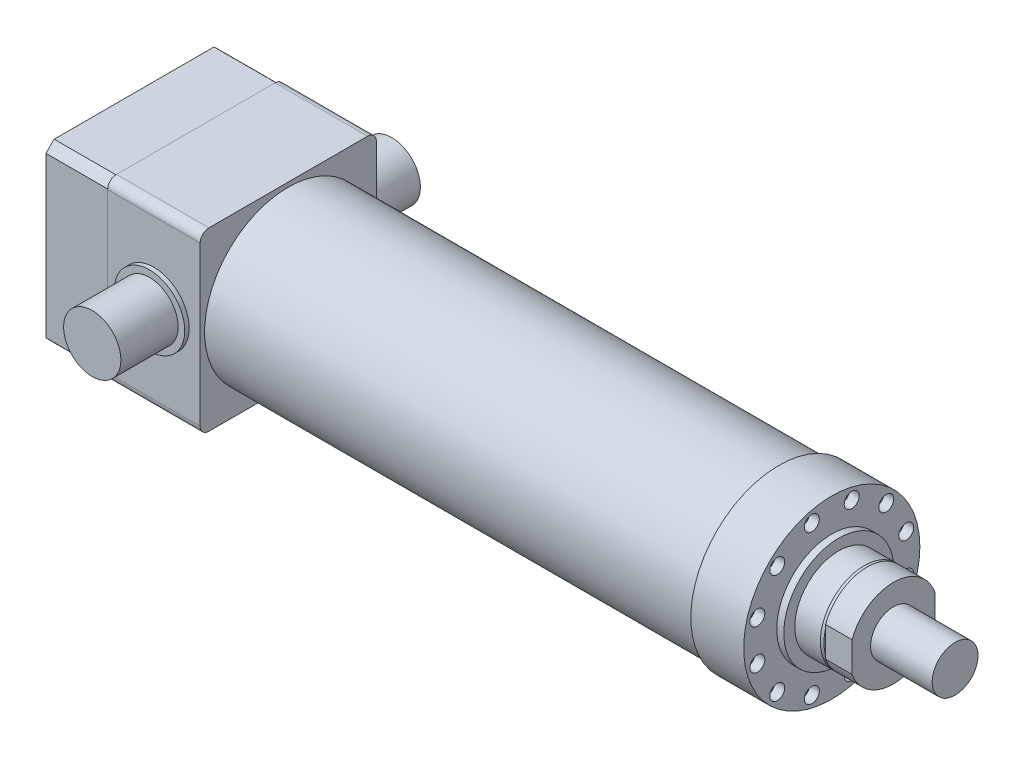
ISO-10303-21;
HEADER;
FILE_DESCRIPTION(('STEP AP214'),'2;1');
FILE_NAME('part.step','',(''),(''),'','','');
FILE_SCHEMA(('AUTOMOTIVE_DESIGN { 1 0 10303 214 1 1 1 1 }'));
ENDSEC;
DATA;
#1=APPLICATION_CONTEXT('core data for automotive mechanical design processes');
#2=APPLICATION_PROTOCOL_DEFINITION('international standard','automotive_design',2000,#1);
#3=PRODUCT_CONTEXT('',#1,'mechanical');
#4=PRODUCT('Part','Part','',(#3));
#5=PRODUCT_RELATED_PRODUCT_CATEGORY('part','',(#4));
#6=PRODUCT_DEFINITION_FORMATION('','',#4);
#7=PRODUCT_DEFINITION_CONTEXT('part definition',#1,'design');
#8=PRODUCT_DEFINITION('design','',#6,#7);
#9=PRODUCT_DEFINITION_SHAPE('','',#8);
#10=(LENGTH_UNIT() NAMED_UNIT(*) SI_UNIT(.MILLI.,.METRE.));
#11=(NAMED_UNIT(*) PLANE_ANGLE_UNIT() SI_UNIT($,.RADIAN.));
#12=(NAMED_UNIT(*) SI_UNIT($,.STERADIAN.) SOLID_ANGLE_UNIT());
#13=UNCERTAINTY_MEASURE_WITH_UNIT(LENGTH_MEASURE(1.E-05),#10,'distance_accuracy_value','');
#14=(GEOMETRIC_REPRESENTATION_CONTEXT(3) GLOBAL_UNCERTAINTY_ASSIGNED_CONTEXT((#13)) GLOBAL_UNIT_ASSIGNED_CONTEXT((#10,
#11,#12)) REPRESENTATION_CONTEXT('',''));
#15=CARTESIAN_POINT('',(0.,0.,0.));
#16=DIRECTION('',(0.,0.,1.));
#17=DIRECTION('',(1.,0.,0.));
#18=AXIS2_PLACEMENT_3D('',#15,#16,#17);
#19=CARTESIAN_POINT('',(757.,0.,0.));
#20=DIRECTION('',(-1.,0.,0.));
#21=DIRECTION('',(0.,0.,1.));
#22=AXIS2_PLACEMENT_3D('',#19,#20,#21);
#23=CYLINDRICAL_SURFACE('',#22,26.);
#24=CARTESIAN_POINT('',(757.,0.,0.));
#25=DIRECTION('',(1.,0.,0.));
#26=DIRECTION('',(0.,0.,-1.));
#27=AXIS2_PLACEMENT_3D('',#24,#25,#26);
#28=CIRCLE('',#27,26.);
#29=CARTESIAN_POINT('',(757.,0.,-26.));
#30=VERTEX_POINT('',#29);
#31=EDGE_CURVE('E11',#30,#30,#28,.T.);
#32=ORIENTED_EDGE('',*,*,#31,.F.);
#33=EDGE_LOOP('',(#32));
#34=FACE_BOUND('',#33,.T.);
#35=CARTESIAN_POINT('',(687.,0.,0.));
#36=DIRECTION('',(1.,0.,0.));
#37=DIRECTION('',(0.,0.,-1.));
#38=AXIS2_PLACEMENT_3D('',#35,#36,#37);
#39=CIRCLE('',#38,26.);
#40=CARTESIAN_POINT('',(687.,0.,-26.));
#41=VERTEX_POINT('',#40);
#42=EDGE_CURVE('E49',#41,#41,#39,.T.);
#43=ORIENTED_EDGE('',*,*,#42,.T.);
#44=EDGE_LOOP('',(#43));
#45=FACE_BOUND('',#44,.T.);
#46=ADVANCED_FACE('F46',(#34,#45),#23,.T.);
#47=CARTESIAN_POINT('',(757.,0.,0.));
#48=DIRECTION('',(1.,0.,0.));
#49=DIRECTION('',(0.,0.,-1.));
#50=AXIS2_PLACEMENT_3D('',#47,#48,#49);
#51=PLANE('',#50);
#52=ORIENTED_EDGE('',*,*,#31,.T.);
#53=EDGE_LOOP('',(#52));
#54=FACE_BOUND('',#53,.T.);
#55=ADVANCED_FACE('F61',(#54),#51,.T.);
#56=CARTESIAN_POINT('',(687.,0.,0.));
#57=DIRECTION('',(1.,0.,0.));
#58=DIRECTION('',(0.,0.,-1.));
#59=AXIS2_PLACEMENT_3D('',#56,#57,#58);
#60=PLANE('',#59);
#61=ORIENTED_EDGE('',*,*,#42,.F.);
#62=EDGE_LOOP('',(#61));
#63=FACE_BOUND('',#62,.T.);
#64=ADVANCED_FACE('F59',(#63),#60,.F.);
#65=CLOSED_SHELL('',(#46,#55,#64));
#66=MANIFOLD_SOLID_BREP('B2',#65);
#67=CARTESIAN_POINT('',(-175.,0.,0.));
#68=DIRECTION('',(1.,0.,0.));
#69=DIRECTION('',(0.,0.,-1.));
#70=AXIS2_PLACEMENT_3D('',#67,#68,#69);
#71=CYLINDRICAL_SURFACE('',#70,135.);
#72=CARTESIAN_POINT('',(-105.,0.,0.));
#73=DIRECTION('',(-1.,0.,0.));
#74=DIRECTION('',(0.,0.,1.));
#75=AXIS2_PLACEMENT_3D('',#72,#73,#74);
#76=CIRCLE('',#75,135.);
#77=CARTESIAN_POINT('',(-105.,100.,-90.6917857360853));
#78=VERTEX_POINT('',#77);
#79=CARTESIAN_POINT('',(-105.,90.6917857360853,-100.));
#80=VERTEX_POINT('',#79);
#81=EDGE_CURVE('E192',#78,#80,#76,.T.);
#82=ORIENTED_EDGE('',*,*,#81,.T.);
#83=DIRECTION('',(1.,0.,0.));
#84=VECTOR('',#83,1.);
#85=CARTESIAN_POINT('',(-175.,90.6917857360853,-100.));
#86=LINE('',#85,#84);
#87=CARTESIAN_POINT('',(-175.,90.6917857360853,-100.));
#88=VERTEX_POINT('',#87);
#89=EDGE_CURVE('E44',#88,#80,#86,.T.);
#90=ORIENTED_EDGE('',*,*,#89,.F.);
#91=CARTESIAN_POINT('',(-175.,0.,0.));
#92=DIRECTION('',(-1.,0.,0.));
#93=DIRECTION('',(0.,0.,1.));
#94=AXIS2_PLACEMENT_3D('',#91,#92,#93);
#95=CIRCLE('',#94,135.);
#96=CARTESIAN_POINT('',(-175.,100.,-90.6917857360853));
#97=VERTEX_POINT('',#96);
#98=EDGE_CURVE('E207',#97,#88,#95,.T.);
#99=ORIENTED_EDGE('',*,*,#98,.F.);
#100=DIRECTION('',(1.,0.,0.));
#101=VECTOR('',#100,1.);
#102=CARTESIAN_POINT('',(-175.,100.,-90.6917857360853));
#103=LINE('',#102,#101);
#104=EDGE_CURVE('E188',#97,#78,#103,.T.);
#105=ORIENTED_EDGE('',*,*,#104,.T.);
#106=EDGE_LOOP('',(#82,#90,#99,#105));
#107=FACE_BOUND('',#106,.T.);
#108=ADVANCED_FACE('F96',(#107),#71,.T.);
#109=CARTESIAN_POINT('',(-175.,90.6917857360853,-100.));
#110=DIRECTION('',(0.,0.,1.));
#111=DIRECTION('',(0.,-1.,0.));
#112=AXIS2_PLACEMENT_3D('',#109,#110,#111);
#113=PLANE('',#112);
#114=DIRECTION('',(0.,-1.,0.));
#115=VECTOR('',#114,1.);
#116=CARTESIAN_POINT('',(-105.,90.6917857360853,-100.));
#117=LINE('',#116,#115);
#118=CARTESIAN_POINT('',(-105.,-90.6917857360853,-100.));
#119=VERTEX_POINT('',#118);
#120=EDGE_CURVE('E195',#80,#119,#117,.T.);
#121=ORIENTED_EDGE('',*,*,#120,.T.);
#122=DIRECTION('',(1.,0.,0.));
#123=VECTOR('',#122,1.);
#124=CARTESIAN_POINT('',(-175.,-90.6917857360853,-100.));
#125=LINE('',#124,#123);
#126=CARTESIAN_POINT('',(-175.,-90.6917857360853,-100.));
#127=VERTEX_POINT('',#126);
#128=EDGE_CURVE('E104',#127,#119,#125,.T.);
#129=ORIENTED_EDGE('',*,*,#128,.F.);
#130=DIRECTION('',(0.,-1.,0.));
#131=VECTOR('',#130,1.);
#132=CARTESIAN_POINT('',(-175.,90.6917857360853,-100.));
#133=LINE('',#132,#131);
#134=EDGE_CURVE('E155',#88,#127,#133,.T.);
#135=ORIENTED_EDGE('',*,*,#134,.F.);
#136=ORIENTED_EDGE('',*,*,#89,.T.);
#137=EDGE_LOOP('',(#121,#129,#135,#136));
#138=FACE_BOUND('',#137,.T.);
#139=ADVANCED_FACE('F302',(#138),#113,.F.);
#140=CARTESIAN_POINT('',(-175.,0.,0.));
#141=DIRECTION('',(1.,0.,0.));
#142=DIRECTION('',(0.,0.,-1.));
#143=AXIS2_PLACEMENT_3D('',#140,#141,#142);
#144=CYLINDRICAL_SURFACE('',#143,135.);
#145=CARTESIAN_POINT('',(-105.,0.,0.));
#146=DIRECTION('',(-1.,0.,0.));
#147=DIRECTION('',(0.,0.,1.));
#148=AXIS2_PLACEMENT_3D('',#145,#146,#147);
#149=CIRCLE('',#148,135.);
#150=CARTESIAN_POINT('',(-105.,-100.,-90.6917857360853));
#151=VERTEX_POINT('',#150);
#152=EDGE_CURVE('E198',#119,#151,#149,.T.);
#153=ORIENTED_EDGE('',*,*,#152,.T.);
#154=DIRECTION('',(1.,0.,0.));
#155=VECTOR('',#154,1.);
#156=CARTESIAN_POINT('',(-175.,-100.,-90.6917857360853));
#157=LINE('',#156,#155);
#158=CARTESIAN_POINT('',(-175.,-100.,-90.6917857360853));
#159=VERTEX_POINT('',#158);
#160=EDGE_CURVE('E214',#159,#151,#157,.T.);
#161=ORIENTED_EDGE('',*,*,#160,.F.);
#162=CARTESIAN_POINT('',(-175.,0.,0.));
#163=DIRECTION('',(-1.,0.,0.));
#164=DIRECTION('',(0.,0.,1.));
#165=AXIS2_PLACEMENT_3D('',#162,#163,#164);
#166=CIRCLE('',#165,135.);
#167=EDGE_CURVE('E222',#127,#159,#166,.T.);
#168=ORIENTED_EDGE('',*,*,#167,.F.);
#169=ORIENTED_EDGE('',*,*,#128,.T.);
#170=EDGE_LOOP('',(#153,#161,#168,#169));
#171=FACE_BOUND('',#170,.T.);
#172=ADVANCED_FACE('F220',(#171),#144,.T.);
#173=CARTESIAN_POINT('',(-175.,-100.,-90.6917857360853));
#174=DIRECTION('',(0.,1.,0.));
#175=DIRECTION('',(0.,0.,1.));
#176=AXIS2_PLACEMENT_3D('',#173,#174,#175);
#177=PLANE('',#176);
#178=DIRECTION('',(0.,0.,1.));
#179=VECTOR('',#178,1.);
#180=CARTESIAN_POINT('',(-105.,-100.,-90.6917857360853));
#181=LINE('',#180,#179);
#182=CARTESIAN_POINT('',(-105.,-100.,90.6917857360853));
#183=VERTEX_POINT('',#182);
#184=EDGE_CURVE('E200',#151,#183,#181,.T.);
#185=ORIENTED_EDGE('',*,*,#184,.T.);
#186=DIRECTION('',(1.,0.,0.));
#187=VECTOR('',#186,1.);
#188=CARTESIAN_POINT('',(-175.,-100.,90.6917857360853));
#189=LINE('',#188,#187);
#190=CARTESIAN_POINT('',(-175.,-100.,90.6917857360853));
#191=VERTEX_POINT('',#190);
#192=EDGE_CURVE('E211',#191,#183,#189,.T.);
#193=ORIENTED_EDGE('',*,*,#192,.F.);
#194=DIRECTION('',(0.,0.,1.));
#195=VECTOR('',#194,1.);
#196=CARTESIAN_POINT('',(-175.,-100.,-90.6917857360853));
#197=LINE('',#196,#195);
#198=EDGE_CURVE('E234',#159,#191,#197,.T.);
#199=ORIENTED_EDGE('',*,*,#198,.F.);
#200=ORIENTED_EDGE('',*,*,#160,.T.);
#201=EDGE_LOOP('',(#185,#193,#199,#200));
#202=FACE_BOUND('',#201,.T.);
#203=ADVANCED_FACE('F230',(#202),#177,.F.);
#204=CARTESIAN_POINT('',(-175.,0.,0.));
#205=DIRECTION('',(1.,0.,0.));
#206=DIRECTION('',(0.,0.,-1.));
#207=AXIS2_PLACEMENT_3D('',#204,#205,#206);
#208=CYLINDRICAL_SURFACE('',#207,135.);
#209=CARTESIAN_POINT('',(-105.,0.,0.));
#210=DIRECTION('',(-1.,0.,0.));
#211=DIRECTION('',(0.,0.,1.));
#212=AXIS2_PLACEMENT_3D('',#209,#210,#211);
#213=CIRCLE('',#212,135.);
#214=CARTESIAN_POINT('',(-105.,-90.6917857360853,100.));
#215=VERTEX_POINT('',#214);
#216=EDGE_CURVE('E202',#183,#215,#213,.T.);
#217=ORIENTED_EDGE('',*,*,#216,.T.);
#218=DIRECTION('',(1.,0.,0.));
#219=VECTOR('',#218,1.);
#220=CARTESIAN_POINT('',(-175.,-90.6917857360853,100.));
#221=LINE('',#220,#219);
#222=CARTESIAN_POINT('',(-175.,-90.6917857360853,100.));
#223=VERTEX_POINT('',#222);
#224=EDGE_CURVE('E183',#223,#215,#221,.T.);
#225=ORIENTED_EDGE('',*,*,#224,.F.);
#226=CARTESIAN_POINT('',(-175.,0.,0.));
#227=DIRECTION('',(-1.,0.,0.));
#228=DIRECTION('',(0.,0.,1.));
#229=AXIS2_PLACEMENT_3D('',#226,#227,#228);
#230=CIRCLE('',#229,135.);
#231=EDGE_CURVE('E174',#191,#223,#230,.T.);
#232=ORIENTED_EDGE('',*,*,#231,.F.);
#233=ORIENTED_EDGE('',*,*,#192,.T.);
#234=EDGE_LOOP('',(#217,#225,#232,#233));
#235=FACE_BOUND('',#234,.T.);
#236=ADVANCED_FACE('F233',(#235),#208,.T.);
#237=CARTESIAN_POINT('',(-175.,90.6917857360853,100.));
#238=DIRECTION('',(0.,0.,-1.));
#239=DIRECTION('',(0.,1.,0.));
#240=AXIS2_PLACEMENT_3D('',#237,#238,#239);
#241=PLANE('',#240);
#242=DIRECTION('',(0.,1.,0.));
#243=VECTOR('',#242,1.);
#244=CARTESIAN_POINT('',(-105.,90.6917857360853,100.));
#245=LINE('',#244,#243);
#246=CARTESIAN_POINT('',(-105.,90.6917857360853,100.));
#247=VERTEX_POINT('',#246);
#248=EDGE_CURVE('E182',#215,#247,#245,.T.);
#249=ORIENTED_EDGE('',*,*,#248,.T.);
#250=DIRECTION('',(1.,0.,0.));
#251=VECTOR('',#250,1.);
#252=CARTESIAN_POINT('',(-175.,90.6917857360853,100.));
#253=LINE('',#252,#251);
#254=CARTESIAN_POINT('',(-175.,90.6917857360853,100.));
#255=VERTEX_POINT('',#254);
#256=EDGE_CURVE('E179',#255,#247,#253,.T.);
#257=ORIENTED_EDGE('',*,*,#256,.F.);
#258=DIRECTION('',(0.,1.,0.));
#259=VECTOR('',#258,1.);
#260=CARTESIAN_POINT('',(-175.,90.6917857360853,100.));
#261=LINE('',#260,#259);
#262=EDGE_CURVE('E168',#223,#255,#261,.T.);
#263=ORIENTED_EDGE('',*,*,#262,.F.);
#264=ORIENTED_EDGE('',*,*,#224,.T.);
#265=EDGE_LOOP('',(#249,#257,#263,#264));
#266=FACE_BOUND('',#265,.T.);
#267=ADVANCED_FACE('F180',(#266),#241,.F.);
#268=CARTESIAN_POINT('',(-175.,0.,0.));
#269=DIRECTION('',(1.,0.,0.));
#270=DIRECTION('',(0.,0.,-1.));
#271=AXIS2_PLACEMENT_3D('',#268,#269,#270);
#272=CYLINDRICAL_SURFACE('',#271,135.);
#273=CARTESIAN_POINT('',(-105.,0.,0.));
#274=DIRECTION('',(-1.,0.,0.));
#275=DIRECTION('',(0.,0.,1.));
#276=AXIS2_PLACEMENT_3D('',#273,#274,#275);
#277=CIRCLE('',#276,135.);
#278=CARTESIAN_POINT('',(-105.,100.,90.6917857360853));
#279=VERTEX_POINT('',#278);
#280=EDGE_CURVE('E141',#247,#279,#277,.T.);
#281=ORIENTED_EDGE('',*,*,#280,.T.);
#282=DIRECTION('',(1.,0.,0.));
#283=VECTOR('',#282,1.);
#284=CARTESIAN_POINT('',(-175.,100.,90.6917857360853));
#285=LINE('',#284,#283);
#286=CARTESIAN_POINT('',(-175.,100.,90.6917857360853));
#287=VERTEX_POINT('',#286);
#288=EDGE_CURVE('E184',#287,#279,#285,.T.);
#289=ORIENTED_EDGE('',*,*,#288,.F.);
#290=CARTESIAN_POINT('',(-175.,0.,0.));
#291=DIRECTION('',(-1.,0.,0.));
#292=DIRECTION('',(0.,0.,1.));
#293=AXIS2_PLACEMENT_3D('',#290,#291,#292);
#294=CIRCLE('',#293,135.);
#295=EDGE_CURVE('E172',#255,#287,#294,.T.);
#296=ORIENTED_EDGE('',*,*,#295,.F.);
#297=ORIENTED_EDGE('',*,*,#256,.T.);
#298=EDGE_LOOP('',(#281,#289,#296,#297));
#299=FACE_BOUND('',#298,.T.);
#300=ADVANCED_FACE('F186',(#299),#272,.T.);
#301=CARTESIAN_POINT('',(-175.,100.,-90.6917857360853));
#302=DIRECTION('',(0.,-1.,0.));
#303=DIRECTION('',(0.,0.,-1.));
#304=AXIS2_PLACEMENT_3D('',#301,#302,#303);
#305=PLANE('',#304);
#306=DIRECTION('',(0.,0.,-1.));
#307=VECTOR('',#306,1.);
#308=CARTESIAN_POINT('',(-105.,100.,-90.6917857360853));
#309=LINE('',#308,#307);
#310=EDGE_CURVE('E147',#279,#78,#309,.T.);
#311=ORIENTED_EDGE('',*,*,#310,.T.);
#312=ORIENTED_EDGE('',*,*,#104,.F.);
#313=DIRECTION('',(0.,0.,-1.));
#314=VECTOR('',#313,1.);
#315=CARTESIAN_POINT('',(-175.,100.,-90.6917857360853));
#316=LINE('',#315,#314);
#317=EDGE_CURVE('E112',#287,#97,#316,.T.);
#318=ORIENTED_EDGE('',*,*,#317,.F.);
#319=ORIENTED_EDGE('',*,*,#288,.T.);
#320=EDGE_LOOP('',(#311,#312,#318,#319));
#321=FACE_BOUND('',#320,.T.);
#322=ADVANCED_FACE('F280',(#321),#305,.F.);
#323=CARTESIAN_POINT('',(-175.,0.,0.));
#324=DIRECTION('',(-1.,0.,0.));
#325=DIRECTION('',(0.,0.,1.));
#326=AXIS2_PLACEMENT_3D('',#323,#324,#325);
#327=PLANE('',#326);
#328=CARTESIAN_POINT('',(-175.,-58.3363094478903,-58.3363094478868));
#329=DIRECTION('',(-1.,0.,0.));
#330=DIRECTION('',(0.,0.,1.));
#331=AXIS2_PLACEMENT_3D('',#328,#329,#330);
#332=CIRCLE('',#331,5.00000000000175);
#333=CARTESIAN_POINT('',(-175.,-58.3363094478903,-53.336309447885));
#334=VERTEX_POINT('',#333);
#335=EDGE_CURVE('E261',#334,#334,#332,.T.);
#336=ORIENTED_EDGE('',*,*,#335,.F.);
#337=EDGE_LOOP('',(#336));
#338=FACE_BOUND('',#337,.T.);
#339=CARTESIAN_POINT('',(-175.,-58.3363094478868,58.3363094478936));
#340=DIRECTION('',(-1.,0.,0.));
#341=DIRECTION('',(0.,0.,1.));
#342=AXIS2_PLACEMENT_3D('',#339,#340,#341);
#343=CIRCLE('',#342,5.00000000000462);
#344=CARTESIAN_POINT('',(-175.,-58.3363094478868,63.3363094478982));
#345=VERTEX_POINT('',#344);
#346=EDGE_CURVE('E267',#345,#345,#343,.T.);
#347=ORIENTED_EDGE('',*,*,#346,.F.);
#348=EDGE_LOOP('',(#347));
#349=FACE_BOUND('',#348,.T.);
#350=CARTESIAN_POINT('',(-175.,58.3363094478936,58.3363094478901));
#351=DIRECTION('',(-1.,0.,0.));
#352=DIRECTION('',(0.,0.,1.));
#353=AXIS2_PLACEMENT_3D('',#350,#351,#352);
#354=CIRCLE('',#353,5.00000000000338);
#355=CARTESIAN_POINT('',(-175.,58.3363094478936,63.3363094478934));
#356=VERTEX_POINT('',#355);
#357=EDGE_CURVE('E255',#356,#356,#354,.T.);
#358=ORIENTED_EDGE('',*,*,#357,.F.);
#359=EDGE_LOOP('',(#358));
#360=FACE_BOUND('',#359,.T.);
#361=CARTESIAN_POINT('',(-175.,58.3363094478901,-58.3363094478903));
#362=DIRECTION('',(-1.,0.,0.));
#363=DIRECTION('',(0.,0.,1.));
#364=AXIS2_PLACEMENT_3D('',#361,#362,#363);
#365=CIRCLE('',#364,5.);
#366=CARTESIAN_POINT('',(-175.,58.3363094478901,-53.3363094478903));
#367=VERTEX_POINT('',#366);
#368=EDGE_CURVE('E252',#367,#367,#365,.T.);
#369=ORIENTED_EDGE('',*,*,#368,.F.);
#370=EDGE_LOOP('',(#369));
#371=FACE_BOUND('',#370,.T.);
#372=CARTESIAN_POINT('',(-175.,0.,0.));
#373=DIRECTION('',(-1.,0.,0.));
#374=DIRECTION('',(0.,0.,1.));
#375=AXIS2_PLACEMENT_3D('',#372,#373,#374);
#376=CIRCLE('',#375,65.);
#377=CARTESIAN_POINT('',(-175.,0.,65.));
#378=VERTEX_POINT('',#377);
#379=EDGE_CURVE('E240',#378,#378,#376,.T.);
#380=ORIENTED_EDGE('',*,*,#379,.F.);
#381=EDGE_LOOP('',(#380));
#382=FACE_BOUND('',#381,.T.);
#383=ORIENTED_EDGE('',*,*,#98,.T.);
#384=ORIENTED_EDGE('',*,*,#134,.T.);
#385=ORIENTED_EDGE('',*,*,#167,.T.);
#386=ORIENTED_EDGE('',*,*,#198,.T.);
#387=ORIENTED_EDGE('',*,*,#231,.T.);
#388=ORIENTED_EDGE('',*,*,#262,.T.);
#389=ORIENTED_EDGE('',*,*,#295,.T.);
#390=ORIENTED_EDGE('',*,*,#317,.T.);
#391=EDGE_LOOP('',(#383,#384,#385,#386,#387,#388,#389,#390));
#392=FACE_BOUND('',#391,.T.);
#393=ADVANCED_FACE('F170',(#338,#349,#360,#371,#382,#392),#327,.T.);
#394=CARTESIAN_POINT('',(-105.,0.,0.));
#395=DIRECTION('',(-1.,0.,0.));
#396=DIRECTION('',(0.,0.,1.));
#397=AXIS2_PLACEMENT_3D('',#394,#395,#396);
#398=PLANE('',#397);
#399=ORIENTED_EDGE('',*,*,#81,.F.);
#400=ORIENTED_EDGE('',*,*,#310,.F.);
#401=ORIENTED_EDGE('',*,*,#280,.F.);
#402=ORIENTED_EDGE('',*,*,#248,.F.);
#403=ORIENTED_EDGE('',*,*,#216,.F.);
#404=ORIENTED_EDGE('',*,*,#184,.F.);
#405=ORIENTED_EDGE('',*,*,#152,.F.);
#406=ORIENTED_EDGE('',*,*,#120,.F.);
#407=EDGE_LOOP('',(#399,#400,#401,#402,#403,#404,#405,#406));
#408=FACE_BOUND('',#407,.T.);
#409=ADVANCED_FACE('F226',(#408),#398,.F.);
#410=CARTESIAN_POINT('',(-145.,0.,0.));
#411=DIRECTION('',(-1.,0.,0.));
#412=DIRECTION('',(0.,0.,1.));
#413=AXIS2_PLACEMENT_3D('',#410,#411,#412);
#414=CYLINDRICAL_SURFACE('',#413,65.);
#415=CARTESIAN_POINT('',(-145.,0.,0.));
#416=DIRECTION('',(-1.,0.,0.));
#417=DIRECTION('',(0.,0.,1.));
#418=AXIS2_PLACEMENT_3D('',#415,#416,#417);
#419=CIRCLE('',#418,65.);
#420=CARTESIAN_POINT('',(-145.,0.,65.));
#421=VERTEX_POINT('',#420);
#422=EDGE_CURVE('E196',#421,#421,#419,.T.);
#423=ORIENTED_EDGE('',*,*,#422,.F.);
#424=EDGE_LOOP('',(#423));
#425=FACE_BOUND('',#424,.T.);
#426=ORIENTED_EDGE('',*,*,#379,.T.);
#427=EDGE_LOOP('',(#426));
#428=FACE_BOUND('',#427,.T.);
#429=ADVANCED_FACE('F287',(#425,#428),#414,.F.);
#430=CARTESIAN_POINT('',(-145.,0.,0.));
#431=DIRECTION('',(-1.,0.,0.));
#432=DIRECTION('',(0.,0.,1.));
#433=AXIS2_PLACEMENT_3D('',#430,#431,#432);
#434=PLANE('',#433);
#435=CARTESIAN_POINT('',(-145.,0.,0.));
#436=DIRECTION('',(-1.,0.,0.));
#437=DIRECTION('',(0.,0.,1.));
#438=AXIS2_PLACEMENT_3D('',#435,#436,#437);
#439=CIRCLE('',#438,55.);
#440=CARTESIAN_POINT('',(-145.,0.,55.));
#441=VERTEX_POINT('',#440);
#442=EDGE_CURVE('E246',#441,#441,#439,.T.);
#443=ORIENTED_EDGE('',*,*,#442,.F.);
#444=EDGE_LOOP('',(#443));
#445=FACE_BOUND('',#444,.T.);
#446=ORIENTED_EDGE('',*,*,#422,.T.);
#447=EDGE_LOOP('',(#446));
#448=FACE_BOUND('',#447,.T.);
#449=ADVANCED_FACE('F289',(#445,#448),#434,.T.);
#450=CARTESIAN_POINT('',(-114.,0.,0.));
#451=DIRECTION('',(-1.,0.,0.));
#452=DIRECTION('',(0.,0.,1.));
#453=AXIS2_PLACEMENT_3D('',#450,#451,#452);
#454=CYLINDRICAL_SURFACE('',#453,55.);
#455=CARTESIAN_POINT('',(-114.,0.,0.));
#456=DIRECTION('',(-1.,0.,0.));
#457=DIRECTION('',(0.,0.,1.));
#458=AXIS2_PLACEMENT_3D('',#455,#456,#457);
#459=CIRCLE('',#458,55.);
#460=CARTESIAN_POINT('',(-114.,0.,55.));
#461=VERTEX_POINT('',#460);
#462=EDGE_CURVE('E243',#461,#461,#459,.T.);
#463=ORIENTED_EDGE('',*,*,#462,.F.);
#464=EDGE_LOOP('',(#463));
#465=FACE_BOUND('',#464,.T.);
#466=ORIENTED_EDGE('',*,*,#442,.T.);
#467=EDGE_LOOP('',(#466));
#468=FACE_BOUND('',#467,.T.);
#469=ADVANCED_FACE('F296',(#465,#468),#454,.F.);
#470=CARTESIAN_POINT('',(-114.,0.,0.));
#471=DIRECTION('',(-1.,0.,0.));
#472=DIRECTION('',(0.,0.,1.));
#473=AXIS2_PLACEMENT_3D('',#470,#471,#472);
#474=PLANE('',#473);
#475=ORIENTED_EDGE('',*,*,#462,.T.);
#476=EDGE_LOOP('',(#475));
#477=FACE_BOUND('',#476,.T.);
#478=ADVANCED_FACE('F373',(#477),#474,.T.);
#479=CARTESIAN_POINT('',(-155.,58.3363094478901,-58.3363094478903));
#480=DIRECTION('',(-1.,0.,0.));
#481=DIRECTION('',(0.,0.,1.));
#482=AXIS2_PLACEMENT_3D('',#479,#480,#481);
#483=CYLINDRICAL_SURFACE('',#482,5.);
#484=CARTESIAN_POINT('',(-155.,58.3363094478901,-58.3363094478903));
#485=DIRECTION('',(-1.,0.,0.));
#486=DIRECTION('',(0.,0.,1.));
#487=AXIS2_PLACEMENT_3D('',#484,#485,#486);
#488=CIRCLE('',#487,5.);
#489=CARTESIAN_POINT('',(-155.,58.3363094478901,-53.3363094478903));
#490=VERTEX_POINT('',#489);
#491=EDGE_CURVE('E249',#490,#490,#488,.T.);
#492=ORIENTED_EDGE('',*,*,#491,.F.);
#493=EDGE_LOOP('',(#492));
#494=FACE_BOUND('',#493,.T.);
#495=ORIENTED_EDGE('',*,*,#368,.T.);
#496=EDGE_LOOP('',(#495));
#497=FACE_BOUND('',#496,.T.);
#498=ADVANCED_FACE('F383',(#494,#497),#483,.F.);
#499=CARTESIAN_POINT('',(-155.,58.3363094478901,-58.3363094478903));
#500=DIRECTION('',(-1.,0.,0.));
#501=DIRECTION('',(0.,0.,1.));
#502=AXIS2_PLACEMENT_3D('',#499,#500,#501);
#503=PLANE('',#502);
#504=ORIENTED_EDGE('',*,*,#491,.T.);
#505=EDGE_LOOP('',(#504));
#506=FACE_BOUND('',#505,.T.);
#507=ADVANCED_FACE('F398',(#506),#503,.T.);
#508=CARTESIAN_POINT('',(-155.,58.3363094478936,58.3363094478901));
#509=DIRECTION('',(-1.,0.,0.));
#510=DIRECTION('',(0.,0.,1.));
#511=AXIS2_PLACEMENT_3D('',#508,#509,#510);
#512=CYLINDRICAL_SURFACE('',#511,5.00000000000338);
#513=CARTESIAN_POINT('',(-155.,58.3363094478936,58.3363094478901));
#514=DIRECTION('',(-1.,0.,0.));
#515=DIRECTION('',(0.,0.,1.));
#516=AXIS2_PLACEMENT_3D('',#513,#514,#515);
#517=CIRCLE('',#516,5.00000000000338);
#518=CARTESIAN_POINT('',(-155.,58.3363094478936,63.3363094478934));
#519=VERTEX_POINT('',#518);
#520=EDGE_CURVE('E270',#519,#519,#517,.T.);
#521=ORIENTED_EDGE('',*,*,#520,.F.);
#522=EDGE_LOOP('',(#521));
#523=FACE_BOUND('',#522,.T.);
#524=ORIENTED_EDGE('',*,*,#357,.T.);
#525=EDGE_LOOP('',(#524));
#526=FACE_BOUND('',#525,.T.);
#527=ADVANCED_FACE('F276',(#523,#526),#512,.F.);
#528=CARTESIAN_POINT('',(-155.,58.3363094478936,58.3363094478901));
#529=DIRECTION('',(-1.,0.,0.));
#530=DIRECTION('',(0.,0.,1.));
#531=AXIS2_PLACEMENT_3D('',#528,#529,#530);
#532=PLANE('',#531);
#533=ORIENTED_EDGE('',*,*,#520,.T.);
#534=EDGE_LOOP('',(#533));
#535=FACE_BOUND('',#534,.T.);
#536=ADVANCED_FACE('F417',(#535),#532,.T.);
#537=CARTESIAN_POINT('',(-155.,-58.3363094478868,58.3363094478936));
#538=DIRECTION('',(-1.,0.,0.));
#539=DIRECTION('',(0.,0.,1.));
#540=AXIS2_PLACEMENT_3D('',#537,#538,#539);
#541=CYLINDRICAL_SURFACE('',#540,5.00000000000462);
#542=CARTESIAN_POINT('',(-155.,-58.3363094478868,58.3363094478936));
#543=DIRECTION('',(-1.,0.,0.));
#544=DIRECTION('',(0.,0.,1.));
#545=AXIS2_PLACEMENT_3D('',#542,#543,#544);
#546=CIRCLE('',#545,5.00000000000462);
#547=CARTESIAN_POINT('',(-155.,-58.3363094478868,63.3363094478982));
#548=VERTEX_POINT('',#547);
#549=EDGE_CURVE('E264',#548,#548,#546,.T.);
#550=ORIENTED_EDGE('',*,*,#549,.F.);
#551=EDGE_LOOP('',(#550));
#552=FACE_BOUND('',#551,.T.);
#553=ORIENTED_EDGE('',*,*,#346,.T.);
#554=EDGE_LOOP('',(#553));
#555=FACE_BOUND('',#554,.T.);
#556=ADVANCED_FACE('F427',(#552,#555),#541,.F.);
#557=CARTESIAN_POINT('',(-155.,-58.3363094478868,58.3363094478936));
#558=DIRECTION('',(-1.,0.,0.));
#559=DIRECTION('',(0.,0.,1.));
#560=AXIS2_PLACEMENT_3D('',#557,#558,#559);
#561=PLANE('',#560);
#562=ORIENTED_EDGE('',*,*,#549,.T.);
#563=EDGE_LOOP('',(#562));
#564=FACE_BOUND('',#563,.T.);
#565=ADVANCED_FACE('F437',(#564),#561,.T.);
#566=CARTESIAN_POINT('',(-155.,-58.3363094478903,-58.3363094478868));
#567=DIRECTION('',(-1.,0.,0.));
#568=DIRECTION('',(0.,0.,1.));
#569=AXIS2_PLACEMENT_3D('',#566,#567,#568);
#570=CYLINDRICAL_SURFACE('',#569,5.00000000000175);
#571=CARTESIAN_POINT('',(-155.,-58.3363094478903,-58.3363094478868));
#572=DIRECTION('',(-1.,0.,0.));
#573=DIRECTION('',(0.,0.,1.));
#574=AXIS2_PLACEMENT_3D('',#571,#572,#573);
#575=CIRCLE('',#574,5.00000000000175);
#576=CARTESIAN_POINT('',(-155.,-58.3363094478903,-53.336309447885));
#577=VERTEX_POINT('',#576);
#578=EDGE_CURVE('E258',#577,#577,#575,.T.);
#579=ORIENTED_EDGE('',*,*,#578,.F.);
#580=EDGE_LOOP('',(#579));
#581=FACE_BOUND('',#580,.T.);
#582=ORIENTED_EDGE('',*,*,#335,.T.);
#583=EDGE_LOOP('',(#582));
#584=FACE_BOUND('',#583,.T.);
#585=ADVANCED_FACE('F447',(#581,#584),#570,.F.);
#586=CARTESIAN_POINT('',(-155.,-58.3363094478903,-58.3363094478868));
#587=DIRECTION('',(-1.,0.,0.));
#588=DIRECTION('',(0.,0.,1.));
#589=AXIS2_PLACEMENT_3D('',#586,#587,#588);
#590=PLANE('',#589);
#591=ORIENTED_EDGE('',*,*,#578,.T.);
#592=EDGE_LOOP('',(#591));
#593=FACE_BOUND('',#592,.T.);
#594=ADVANCED_FACE('F457',(#593),#590,.T.);
#595=CLOSED_SHELL('',(#108,#139,#172,#203,#236,#267,#300,#322,#393,#409,#429,#449,#469,#478,
#498,#507,#527,#536,#556,#565,#585,#594));
#596=MANIFOLD_SOLID_BREP('B6',#595);
#597=CARTESIAN_POINT('',(-105.,89.9999999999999,99.9999999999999));
#598=DIRECTION('',(0.,0.,-1.));
#599=DIRECTION('',(0.,1.,0.));
#600=AXIS2_PLACEMENT_3D('',#597,#598,#599);
#601=PLANE('',#600);
#602=DIRECTION('',(0.,1.,0.));
#603=VECTOR('',#602,1.);
#604=CARTESIAN_POINT('',(0.,89.9999999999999,99.9999999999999));
#605=LINE('',#604,#603);
#606=CARTESIAN_POINT('',(0.,-90.,100.));
#607=VERTEX_POINT('',#606);
#608=CARTESIAN_POINT('',(0.,89.9999999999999,99.9999999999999));
#609=VERTEX_POINT('',#608);
#610=EDGE_CURVE('E989',#607,#609,#605,.T.);
#611=ORIENTED_EDGE('',*,*,#610,.T.);
#612=DIRECTION('',(1.,0.,0.));
#613=VECTOR('',#612,1.);
#614=CARTESIAN_POINT('',(-105.,89.9999999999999,99.9999999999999));
#615=LINE('',#614,#613);
#616=CARTESIAN_POINT('',(-105.,89.9999999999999,99.9999999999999));
#617=VERTEX_POINT('',#616);
#618=EDGE_CURVE('E613',#617,#609,#615,.T.);
#619=ORIENTED_EDGE('',*,*,#618,.F.);
#620=DIRECTION('',(0.,1.,0.));
#621=VECTOR('',#620,1.);
#622=CARTESIAN_POINT('',(-105.,89.9999999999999,99.9999999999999));
#623=LINE('',#622,#621);
#624=CARTESIAN_POINT('',(-105.,-90.,100.));
#625=VERTEX_POINT('',#624);
#626=EDGE_CURVE('E606',#625,#617,#623,.T.);
#627=ORIENTED_EDGE('',*,*,#626,.F.);
#628=DIRECTION('',(1.,0.,0.));
#629=VECTOR('',#628,1.);
#630=CARTESIAN_POINT('',(-105.,-90.,100.));
#631=LINE('',#630,#629);
#632=EDGE_CURVE('E610',#625,#607,#631,.T.);
#633=ORIENTED_EDGE('',*,*,#632,.T.);
#634=EDGE_LOOP('',(#611,#619,#627,#633));
#635=FACE_BOUND('',#634,.T.);
#636=CARTESIAN_POINT('',(-52.5,0.,100.));
#637=DIRECTION('',(0.,0.,-1.));
#638=DIRECTION('',(0.,1.,0.));
#639=AXIS2_PLACEMENT_3D('',#636,#637,#638);
#640=CIRCLE('',#639,40.);
#641=CARTESIAN_POINT('',(-52.5,40.,100.));
#642=VERTEX_POINT('',#641);
#643=EDGE_CURVE('E94',#642,#642,#640,.F.);
#644=ORIENTED_EDGE('',*,*,#643,.F.);
#645=EDGE_LOOP('',(#644));
#646=FACE_BOUND('',#645,.T.);
#647=ADVANCED_FACE('F505',(#635,#646),#601,.F.);
#648=CARTESIAN_POINT('',(657.,0.,0.));
#649=DIRECTION('',(1.,0.,0.));
#650=DIRECTION('',(0.,0.,-1.));
#651=AXIS2_PLACEMENT_3D('',#648,#649,#650);
#652=PLANE('',#651);
#653=CARTESIAN_POINT('',(657.,0.,0.));
#654=DIRECTION('',(1.,0.,0.));
#655=DIRECTION('',(0.,0.,-1.));
#656=AXIS2_PLACEMENT_3D('',#653,#654,#655);
#657=CIRCLE('',#656,48.9080892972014);
#658=CARTESIAN_POINT('',(657.,-13.5277935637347,-47.));
#659=VERTEX_POINT('',#658);
#660=CARTESIAN_POINT('',(657.,13.5277935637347,-47.));
#661=VERTEX_POINT('',#660);
#662=EDGE_CURVE('E682',#659,#661,#657,.T.);
#663=ORIENTED_EDGE('',*,*,#662,.T.);
#664=DIRECTION('',(0.,-1.,0.));
#665=VECTOR('',#664,1.);
#666=CARTESIAN_POINT('',(657.,17.058722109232,-47.));
#667=LINE('',#666,#665);
#668=EDGE_CURVE('E514',#661,#659,#667,.T.);
#669=ORIENTED_EDGE('',*,*,#668,.T.);
#670=EDGE_LOOP('',(#663,#669));
#671=FACE_BOUND('',#670,.T.);
#672=ADVANCED_FACE('F813',(#671),#652,.T.);
#673=CARTESIAN_POINT('',(557.,0.,0.));
#674=DIRECTION('',(-1.,0.,0.));
#675=DIRECTION('',(0.,0.,1.));
#676=AXIS2_PLACEMENT_3D('',#673,#674,#675);
#677=CYLINDRICAL_SURFACE('',#676,95.);
#678=CARTESIAN_POINT('',(557.,0.,0.));
#679=DIRECTION('',(1.,0.,0.));
#680=DIRECTION('',(0.,0.,-1.));
#681=AXIS2_PLACEMENT_3D('',#678,#679,#680);
#682=CIRCLE('',#681,95.);
#683=CARTESIAN_POINT('',(557.,0.,-95.));
#684=VERTEX_POINT('',#683);
#685=EDGE_CURVE('E761',#684,#684,#682,.T.);
#686=ORIENTED_EDGE('',*,*,#685,.F.);
#687=EDGE_LOOP('',(#686));
#688=FACE_BOUND('',#687,.T.);
#689=CARTESIAN_POINT('',(0.,0.,0.));
#690=DIRECTION('',(1.,0.,0.));
#691=DIRECTION('',(0.,0.,-1.));
#692=AXIS2_PLACEMENT_3D('',#689,#690,#691);
#693=CIRCLE('',#692,95.);
#694=CARTESIAN_POINT('',(0.,0.,-95.));
#695=VERTEX_POINT('',#694);
#696=EDGE_CURVE('E631',#695,#695,#693,.T.);
#697=ORIENTED_EDGE('',*,*,#696,.T.);
#698=EDGE_LOOP('',(#697));
#699=FACE_BOUND('',#698,.T.);
#700=ADVANCED_FACE('F815',(#688,#699),#677,.T.);
#701=CARTESIAN_POINT('',(617.,0.,0.));
#702=DIRECTION('',(-1.,0.,0.));
#703=DIRECTION('',(0.,0.,1.));
#704=AXIS2_PLACEMENT_3D('',#701,#702,#703);
#705=CYLINDRICAL_SURFACE('',#704,100.);
#706=CARTESIAN_POINT('',(617.,0.,0.));
#707=DIRECTION('',(1.,0.,0.));
#708=DIRECTION('',(0.,0.,-1.));
#709=AXIS2_PLACEMENT_3D('',#706,#707,#708);
#710=CIRCLE('',#709,100.);
#711=CARTESIAN_POINT('',(617.,0.,-100.));
#712=VERTEX_POINT('',#711);
#713=EDGE_CURVE('E762',#712,#712,#710,.T.);
#714=ORIENTED_EDGE('',*,*,#713,.F.);
#715=EDGE_LOOP('',(#714));
#716=FACE_BOUND('',#715,.T.);
#717=CARTESIAN_POINT('',(557.,0.,0.));
#718=DIRECTION('',(1.,0.,0.));
#719=DIRECTION('',(0.,0.,-1.));
#720=AXIS2_PLACEMENT_3D('',#717,#718,#719);
#721=CIRCLE('',#720,100.);
#722=CARTESIAN_POINT('',(557.,0.,-100.));
#723=VERTEX_POINT('',#722);
#724=EDGE_CURVE('E758',#723,#723,#721,.T.);
#725=ORIENTED_EDGE('',*,*,#724,.T.);
#726=EDGE_LOOP('',(#725));
#727=FACE_BOUND('',#726,.T.);
#728=ADVANCED_FACE('F822',(#716,#727),#705,.T.);
#729=CARTESIAN_POINT('',(617.,0.,0.));
#730=DIRECTION('',(1.,0.,0.));
#731=DIRECTION('',(0.,0.,-1.));
#732=AXIS2_PLACEMENT_3D('',#729,#730,#731);
#733=PLANE('',#732);
#734=CARTESIAN_POINT('',(617.,61.8718433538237,61.8718433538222));
#735=DIRECTION('',(1.,0.,0.));
#736=DIRECTION('',(0.,0.,-1.));
#737=AXIS2_PLACEMENT_3D('',#734,#735,#736);
#738=CIRCLE('',#737,8.50000000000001);
#739=CARTESIAN_POINT('',(617.,61.8718433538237,53.3718433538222));
#740=VERTEX_POINT('',#739);
#741=EDGE_CURVE('E702',#740,#740,#738,.T.);
#742=ORIENTED_EDGE('',*,*,#741,.F.);
#743=EDGE_LOOP('',(#742));
#744=FACE_BOUND('',#743,.T.);
#745=CARTESIAN_POINT('',(617.,22.6466664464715,84.5185098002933));
#746=DIRECTION('',(1.,0.,0.));
#747=DIRECTION('',(0.,0.,-1.));
#748=AXIS2_PLACEMENT_3D('',#745,#746,#747);
#749=CIRCLE('',#748,8.5);
#750=CARTESIAN_POINT('',(617.,22.6466664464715,76.0185098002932));
#751=VERTEX_POINT('',#750);
#752=EDGE_CURVE('E709',#751,#751,#749,.T.);
#753=ORIENTED_EDGE('',*,*,#752,.F.);
#754=EDGE_LOOP('',(#753));
#755=FACE_BOUND('',#754,.T.);
#756=CARTESIAN_POINT('',(617.,-22.6466664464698,84.5185098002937));
#757=DIRECTION('',(1.,0.,0.));
#758=DIRECTION('',(0.,0.,-1.));
#759=AXIS2_PLACEMENT_3D('',#756,#757,#758);
#760=CIRCLE('',#759,8.5);
#761=CARTESIAN_POINT('',(617.,-22.6466664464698,76.0185098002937));
#762=VERTEX_POINT('',#761);
#763=EDGE_CURVE('E715',#762,#762,#760,.T.);
#764=ORIENTED_EDGE('',*,*,#763,.F.);
#765=EDGE_LOOP('',(#764));
#766=FACE_BOUND('',#765,.T.);
#767=CARTESIAN_POINT('',(617.,-61.8718433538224,61.8718433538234));
#768=DIRECTION('',(1.,0.,0.));
#769=DIRECTION('',(0.,0.,-1.));
#770=AXIS2_PLACEMENT_3D('',#767,#768,#769);
#771=CIRCLE('',#770,8.5);
#772=CARTESIAN_POINT('',(617.,-61.8718433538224,53.3718433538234));
#773=VERTEX_POINT('',#772);
#774=EDGE_CURVE('E721',#773,#773,#771,.T.);
#775=ORIENTED_EDGE('',*,*,#774,.F.);
#776=EDGE_LOOP('',(#775));
#777=FACE_BOUND('',#776,.T.);
#778=CARTESIAN_POINT('',(617.,-84.5185098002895,22.6466664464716));
#779=DIRECTION('',(1.,0.,0.));
#780=DIRECTION('',(0.,0.,-1.));
#781=AXIS2_PLACEMENT_3D('',#778,#779,#780);
#782=CIRCLE('',#781,8.49999999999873);
#783=CARTESIAN_POINT('',(617.,-84.5185098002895,14.1466664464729));
#784=VERTEX_POINT('',#783);
#785=EDGE_CURVE('E727',#784,#784,#782,.T.);
#786=ORIENTED_EDGE('',*,*,#785,.F.);
#787=EDGE_LOOP('',(#786));
#788=FACE_BOUND('',#787,.T.);
#789=CARTESIAN_POINT('',(617.,-84.5185098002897,-22.6466664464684));
#790=DIRECTION('',(1.,0.,0.));
#791=DIRECTION('',(0.,0.,-1.));
#792=AXIS2_PLACEMENT_3D('',#789,#790,#791);
#793=CIRCLE('',#792,8.49999999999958);
#794=CARTESIAN_POINT('',(617.,-84.5185098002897,-31.146666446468));
#795=VERTEX_POINT('',#794);
#796=EDGE_CURVE('E733',#795,#795,#793,.T.);
#797=ORIENTED_EDGE('',*,*,#796,.F.);
#798=EDGE_LOOP('',(#797));
#799=FACE_BOUND('',#798,.T.);
#800=CARTESIAN_POINT('',(617.,-61.8718433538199,-61.87184335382));
#801=DIRECTION('',(1.,0.,0.));
#802=DIRECTION('',(0.,0.,-1.));
#803=AXIS2_PLACEMENT_3D('',#800,#801,#802);
#804=CIRCLE('',#803,8.50000000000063);
#805=CARTESIAN_POINT('',(617.,-61.8718433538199,-70.3718433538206));
#806=VERTEX_POINT('',#805);
#807=EDGE_CURVE('E739',#806,#806,#804,.T.);
#808=ORIENTED_EDGE('',*,*,#807,.F.);
#809=EDGE_LOOP('',(#808));
#810=FACE_BOUND('',#809,.T.);
#811=CARTESIAN_POINT('',(617.,-22.6466664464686,-84.5185098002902));
#812=DIRECTION('',(1.,0.,0.));
#813=DIRECTION('',(0.,0.,-1.));
#814=AXIS2_PLACEMENT_3D('',#811,#812,#813);
#815=CIRCLE('',#814,8.5000000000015);
#816=CARTESIAN_POINT('',(617.,-22.6466664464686,-93.0185098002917));
#817=VERTEX_POINT('',#816);
#818=EDGE_CURVE('E745',#817,#817,#815,.T.);
#819=ORIENTED_EDGE('',*,*,#818,.F.);
#820=EDGE_LOOP('',(#819));
#821=FACE_BOUND('',#820,.T.);
#822=CARTESIAN_POINT('',(617.,22.6466664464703,-84.5185098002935));
#823=DIRECTION('',(1.,0.,0.));
#824=DIRECTION('',(0.,0.,-1.));
#825=AXIS2_PLACEMENT_3D('',#822,#823,#824);
#826=CIRCLE('',#825,8.5);
#827=CARTESIAN_POINT('',(617.,22.6466664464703,-93.0185098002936));
#828=VERTEX_POINT('',#827);
#829=EDGE_CURVE('E684',#828,#828,#826,.T.);
#830=ORIENTED_EDGE('',*,*,#829,.F.);
#831=EDGE_LOOP('',(#830));
#832=FACE_BOUND('',#831,.T.);
#833=CARTESIAN_POINT('',(617.,61.8718433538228,-61.871843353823));
#834=DIRECTION('',(1.,0.,0.));
#835=DIRECTION('',(0.,0.,-1.));
#836=AXIS2_PLACEMENT_3D('',#833,#834,#835);
#837=CIRCLE('',#836,8.50000000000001);
#838=CARTESIAN_POINT('',(617.,61.8718433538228,-70.371843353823));
#839=VERTEX_POINT('',#838);
#840=EDGE_CURVE('E691',#839,#839,#837,.T.);
#841=ORIENTED_EDGE('',*,*,#840,.F.);
#842=EDGE_LOOP('',(#841));
#843=FACE_BOUND('',#842,.T.);
#844=CARTESIAN_POINT('',(617.,84.5185098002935,-22.6466664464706));
#845=DIRECTION('',(1.,0.,0.));
#846=DIRECTION('',(0.,0.,-1.));
#847=AXIS2_PLACEMENT_3D('',#844,#845,#846);
#848=CIRCLE('',#847,8.50000000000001);
#849=CARTESIAN_POINT('',(617.,84.5185098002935,-31.1466664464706));
#850=VERTEX_POINT('',#849);
#851=EDGE_CURVE('E697',#850,#850,#848,.T.);
#852=ORIENTED_EDGE('',*,*,#851,.F.);
#853=EDGE_LOOP('',(#852));
#854=FACE_BOUND('',#853,.T.);
#855=CARTESIAN_POINT('',(617.,84.5185098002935,22.6466664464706));
#856=DIRECTION('',(1.,0.,0.));
#857=DIRECTION('',(0.,0.,-1.));
#858=AXIS2_PLACEMENT_3D('',#855,#856,#857);
#859=CIRCLE('',#858,8.5);
#860=CARTESIAN_POINT('',(617.,84.5185098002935,14.1466664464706));
#861=VERTEX_POINT('',#860);
#862=EDGE_CURVE('E705',#861,#861,#859,.T.);
#863=ORIENTED_EDGE('',*,*,#862,.F.);
#864=EDGE_LOOP('',(#863));
#865=FACE_BOUND('',#864,.T.);
#866=CARTESIAN_POINT('',(617.,0.,0.));
#867=DIRECTION('',(1.,0.,0.));
#868=DIRECTION('',(0.,0.,-1.));
#869=AXIS2_PLACEMENT_3D('',#866,#867,#868);
#870=CIRCLE('',#869,62.5);
#871=CARTESIAN_POINT('',(617.,0.,-62.5));
#872=VERTEX_POINT('',#871);
#873=EDGE_CURVE('E683',#872,#872,#870,.T.);
#874=ORIENTED_EDGE('',*,*,#873,.F.);
#875=EDGE_LOOP('',(#874));
#876=FACE_BOUND('',#875,.T.);
#877=ORIENTED_EDGE('',*,*,#713,.T.);
#878=EDGE_LOOP('',(#877));
#879=FACE_BOUND('',#878,.T.);
#880=ADVANCED_FACE('F943',(#744,#755,#766,#777,#788,#799,#810,#821,#832,#843,#854,#865,#876,
#879),#733,.T.);
#881=CARTESIAN_POINT('',(557.,0.,0.));
#882=DIRECTION('',(1.,0.,0.));
#883=DIRECTION('',(0.,0.,-1.));
#884=AXIS2_PLACEMENT_3D('',#881,#882,#883);
#885=PLANE('',#884);
#886=ORIENTED_EDGE('',*,*,#685,.T.);
#887=EDGE_LOOP('',(#886));
#888=FACE_BOUND('',#887,.T.);
#889=ORIENTED_EDGE('',*,*,#724,.F.);
#890=EDGE_LOOP('',(#889));
#891=FACE_BOUND('',#890,.T.);
#892=ADVANCED_FACE('F941',(#888,#891),#885,.F.);
#893=CARTESIAN_POINT('',(625.,0.,0.));
#894=DIRECTION('',(-1.,0.,0.));
#895=DIRECTION('',(0.,0.,1.));
#896=AXIS2_PLACEMENT_3D('',#893,#894,#895);
#897=CYLINDRICAL_SURFACE('',#896,62.5);
#898=CARTESIAN_POINT('',(625.,0.,0.));
#899=DIRECTION('',(1.,0.,0.));
#900=DIRECTION('',(0.,0.,-1.));
#901=AXIS2_PLACEMENT_3D('',#898,#899,#900);
#902=CIRCLE('',#901,62.5);
#903=CARTESIAN_POINT('',(625.,0.,-62.5));
#904=VERTEX_POINT('',#903);
#905=EDGE_CURVE('E753',#904,#904,#902,.T.);
#906=ORIENTED_EDGE('',*,*,#905,.F.);
#907=EDGE_LOOP('',(#906));
#908=FACE_BOUND('',#907,.T.);
#909=ORIENTED_EDGE('',*,*,#873,.T.);
#910=EDGE_LOOP('',(#909));
#911=FACE_BOUND('',#910,.T.);
#912=ADVANCED_FACE('F937',(#908,#911),#897,.T.);
#913=CARTESIAN_POINT('',(625.,0.,0.));
#914=DIRECTION('',(1.,0.,0.));
#915=DIRECTION('',(0.,0.,-1.));
#916=AXIS2_PLACEMENT_3D('',#913,#914,#915);
#917=PLANE('',#916);
#918=CARTESIAN_POINT('',(625.,0.,0.));
#919=DIRECTION('',(1.,0.,0.));
#920=DIRECTION('',(0.,0.,-1.));
#921=AXIS2_PLACEMENT_3D('',#918,#919,#920);
#922=CIRCLE('',#921,50.);
#923=CARTESIAN_POINT('',(625.,0.,-50.));
#924=VERTEX_POINT('',#923);
#925=EDGE_CURVE('E679',#924,#924,#922,.T.);
#926=ORIENTED_EDGE('',*,*,#925,.F.);
#927=EDGE_LOOP('',(#926));
#928=FACE_BOUND('',#927,.T.);
#929=ORIENTED_EDGE('',*,*,#905,.T.);
#930=EDGE_LOOP('',(#929));
#931=FACE_BOUND('',#930,.T.);
#932=ADVANCED_FACE('F933',(#928,#931),#917,.T.);
#933=CARTESIAN_POINT('',(606.,84.5185098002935,22.6466664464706));
#934=DIRECTION('',(1.,0.,0.));
#935=DIRECTION('',(0.,0.,-1.));
#936=AXIS2_PLACEMENT_3D('',#933,#934,#935);
#937=CYLINDRICAL_SURFACE('',#936,8.5);
#938=CARTESIAN_POINT('',(606.,84.5185098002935,22.6466664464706));
#939=DIRECTION('',(1.,0.,0.));
#940=DIRECTION('',(0.,0.,-1.));
#941=AXIS2_PLACEMENT_3D('',#938,#939,#940);
#942=CIRCLE('',#941,8.5);
#943=CARTESIAN_POINT('',(606.,84.5185098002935,14.1466664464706));
#944=VERTEX_POINT('',#943);
#945=EDGE_CURVE('E750',#944,#944,#942,.T.);
#946=ORIENTED_EDGE('',*,*,#945,.F.);
#947=EDGE_LOOP('',(#946));
#948=FACE_BOUND('',#947,.T.);
#949=ORIENTED_EDGE('',*,*,#862,.T.);
#950=EDGE_LOOP('',(#949));
#951=FACE_BOUND('',#950,.T.);
#952=ADVANCED_FACE('F929',(#948,#951),#937,.F.);
#953=CARTESIAN_POINT('',(606.,84.5185098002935,22.6466664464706));
#954=DIRECTION('',(1.,0.,0.));
#955=DIRECTION('',(0.,0.,-1.));
#956=AXIS2_PLACEMENT_3D('',#953,#954,#955);
#957=PLANE('',#956);
#958=ORIENTED_EDGE('',*,*,#945,.T.);
#959=EDGE_LOOP('',(#958));
#960=FACE_BOUND('',#959,.T.);
#961=ADVANCED_FACE('F864',(#960),#957,.T.);
#962=CARTESIAN_POINT('',(606.,84.5185098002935,-22.6466664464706));
#963=DIRECTION('',(1.,0.,0.));
#964=DIRECTION('',(0.,0.,-1.));
#965=AXIS2_PLACEMENT_3D('',#962,#963,#964);
#966=CYLINDRICAL_SURFACE('',#965,8.50000000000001);
#967=CARTESIAN_POINT('',(606.,84.5185098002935,-22.6466664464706));
#968=DIRECTION('',(1.,0.,0.));
#969=DIRECTION('',(0.,0.,-1.));
#970=AXIS2_PLACEMENT_3D('',#967,#968,#969);
#971=CIRCLE('',#970,8.50000000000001);
#972=CARTESIAN_POINT('',(606.,84.5185098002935,-31.1466664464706));
#973=VERTEX_POINT('',#972);
#974=EDGE_CURVE('E670',#973,#973,#971,.T.);
#975=ORIENTED_EDGE('',*,*,#974,.F.);
#976=EDGE_LOOP('',(#975));
#977=FACE_BOUND('',#976,.T.);
#978=ORIENTED_EDGE('',*,*,#851,.T.);
#979=EDGE_LOOP('',(#978));
#980=FACE_BOUND('',#979,.T.);
#981=ADVANCED_FACE('F861',(#977,#980),#966,.F.);
#982=CARTESIAN_POINT('',(606.,84.5185098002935,-22.6466664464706));
#983=DIRECTION('',(1.,0.,0.));
#984=DIRECTION('',(0.,0.,-1.));
#985=AXIS2_PLACEMENT_3D('',#982,#983,#984);
#986=PLANE('',#985);
#987=ORIENTED_EDGE('',*,*,#974,.T.);
#988=EDGE_LOOP('',(#987));
#989=FACE_BOUND('',#988,.T.);
#990=ADVANCED_FACE('F856',(#989),#986,.T.);
#991=CARTESIAN_POINT('',(606.,61.8718433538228,-61.871843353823));
#992=DIRECTION('',(1.,0.,0.));
#993=DIRECTION('',(0.,0.,-1.));
#994=AXIS2_PLACEMENT_3D('',#991,#992,#993);
#995=CYLINDRICAL_SURFACE('',#994,8.50000000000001);
#996=CARTESIAN_POINT('',(606.,61.8718433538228,-61.871843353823));
#997=DIRECTION('',(1.,0.,0.));
#998=DIRECTION('',(0.,0.,-1.));
#999=AXIS2_PLACEMENT_3D('',#996,#997,#998);
#1000=CIRCLE('',#999,8.50000000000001);
#1001=CARTESIAN_POINT('',(606.,61.8718433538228,-70.371843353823));
#1002=VERTEX_POINT('',#1001);
#1003=EDGE_CURVE('E694',#1002,#1002,#1000,.T.);
#1004=ORIENTED_EDGE('',*,*,#1003,.F.);
#1005=EDGE_LOOP('',(#1004));
#1006=FACE_BOUND('',#1005,.T.);
#1007=ORIENTED_EDGE('',*,*,#840,.T.);
#1008=EDGE_LOOP('',(#1007));
#1009=FACE_BOUND('',#1008,.T.);
#1010=ADVANCED_FACE('F853',(#1006,#1009),#995,.F.);
#1011=CARTESIAN_POINT('',(606.,61.8718433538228,-61.871843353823));
#1012=DIRECTION('',(1.,0.,0.));
#1013=DIRECTION('',(0.,0.,-1.));
#1014=AXIS2_PLACEMENT_3D('',#1011,#1012,#1013);
#1015=PLANE('',#1014);
#1016=ORIENTED_EDGE('',*,*,#1003,.T.);
#1017=EDGE_LOOP('',(#1016));
#1018=FACE_BOUND('',#1017,.T.);
#1019=ADVANCED_FACE('F847',(#1018),#1015,.T.);
#1020=CARTESIAN_POINT('',(606.,22.6466664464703,-84.5185098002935));
#1021=DIRECTION('',(1.,0.,0.));
#1022=DIRECTION('',(0.,0.,-1.));
#1023=AXIS2_PLACEMENT_3D('',#1020,#1021,#1022);
#1024=CYLINDRICAL_SURFACE('',#1023,8.5);
#1025=CARTESIAN_POINT('',(606.,22.6466664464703,-84.5185098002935));
#1026=DIRECTION('',(1.,0.,0.));
#1027=DIRECTION('',(0.,0.,-1.));
#1028=AXIS2_PLACEMENT_3D('',#1025,#1026,#1027);
#1029=CIRCLE('',#1028,8.5);
#1030=CARTESIAN_POINT('',(606.,22.6466664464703,-93.0185098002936));
#1031=VERTEX_POINT('',#1030);
#1032=EDGE_CURVE('E688',#1031,#1031,#1029,.T.);
#1033=ORIENTED_EDGE('',*,*,#1032,.F.);
#1034=EDGE_LOOP('',(#1033));
#1035=FACE_BOUND('',#1034,.T.);
#1036=ORIENTED_EDGE('',*,*,#829,.T.);
#1037=EDGE_LOOP('',(#1036));
#1038=FACE_BOUND('',#1037,.T.);
#1039=ADVANCED_FACE('F843',(#1035,#1038),#1024,.F.);
#1040=CARTESIAN_POINT('',(606.,22.6466664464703,-84.5185098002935));
#1041=DIRECTION('',(1.,0.,0.));
#1042=DIRECTION('',(0.,0.,-1.));
#1043=AXIS2_PLACEMENT_3D('',#1040,#1041,#1042);
#1044=PLANE('',#1043);
#1045=ORIENTED_EDGE('',*,*,#1032,.T.);
#1046=EDGE_LOOP('',(#1045));
#1047=FACE_BOUND('',#1046,.T.);
#1048=ADVANCED_FACE('F846',(#1047),#1044,.T.);
#1049=CARTESIAN_POINT('',(606.,-22.6466664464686,-84.5185098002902));
#1050=DIRECTION('',(1.,0.,0.));
#1051=DIRECTION('',(0.,0.,-1.));
#1052=AXIS2_PLACEMENT_3D('',#1049,#1050,#1051);
#1053=CYLINDRICAL_SURFACE('',#1052,8.5000000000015);
#1054=CARTESIAN_POINT('',(606.,-22.6466664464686,-84.5185098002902));
#1055=DIRECTION('',(1.,0.,0.));
#1056=DIRECTION('',(0.,0.,-1.));
#1057=AXIS2_PLACEMENT_3D('',#1054,#1055,#1056);
#1058=CIRCLE('',#1057,8.5000000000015);
#1059=CARTESIAN_POINT('',(606.,-22.6466664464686,-93.0185098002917));
#1060=VERTEX_POINT('',#1059);
#1061=EDGE_CURVE('E687',#1060,#1060,#1058,.T.);
#1062=ORIENTED_EDGE('',*,*,#1061,.F.);
#1063=EDGE_LOOP('',(#1062));
#1064=FACE_BOUND('',#1063,.T.);
#1065=ORIENTED_EDGE('',*,*,#818,.T.);
#1066=EDGE_LOOP('',(#1065));
#1067=FACE_BOUND('',#1066,.T.);
#1068=ADVANCED_FACE('F851',(#1064,#1067),#1053,.F.);
#1069=CARTESIAN_POINT('',(606.,-22.6466664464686,-84.5185098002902));
#1070=DIRECTION('',(1.,0.,0.));
#1071=DIRECTION('',(0.,0.,-1.));
#1072=AXIS2_PLACEMENT_3D('',#1069,#1070,#1071);
#1073=PLANE('',#1072);
#1074=ORIENTED_EDGE('',*,*,#1061,.T.);
#1075=EDGE_LOOP('',(#1074));
#1076=FACE_BOUND('',#1075,.T.);
#1077=ADVANCED_FACE('F916',(#1076),#1073,.T.);
#1078=CARTESIAN_POINT('',(606.,-61.8718433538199,-61.87184335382));
#1079=DIRECTION('',(1.,0.,0.));
#1080=DIRECTION('',(0.,0.,-1.));
#1081=AXIS2_PLACEMENT_3D('',#1078,#1079,#1080);
#1082=CYLINDRICAL_SURFACE('',#1081,8.50000000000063);
#1083=CARTESIAN_POINT('',(606.,-61.8718433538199,-61.87184335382));
#1084=DIRECTION('',(1.,0.,0.));
#1085=DIRECTION('',(0.,0.,-1.));
#1086=AXIS2_PLACEMENT_3D('',#1083,#1084,#1085);
#1087=CIRCLE('',#1086,8.50000000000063);
#1088=CARTESIAN_POINT('',(606.,-61.8718433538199,-70.3718433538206));
#1089=VERTEX_POINT('',#1088);
#1090=EDGE_CURVE('E742',#1089,#1089,#1087,.T.);
#1091=ORIENTED_EDGE('',*,*,#1090,.F.);
#1092=EDGE_LOOP('',(#1091));
#1093=FACE_BOUND('',#1092,.T.);
#1094=ORIENTED_EDGE('',*,*,#807,.T.);
#1095=EDGE_LOOP('',(#1094));
#1096=FACE_BOUND('',#1095,.T.);
#1097=ADVANCED_FACE('F913',(#1093,#1096),#1082,.F.);
#1098=CARTESIAN_POINT('',(606.,-61.8718433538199,-61.87184335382));
#1099=DIRECTION('',(1.,0.,0.));
#1100=DIRECTION('',(0.,0.,-1.));
#1101=AXIS2_PLACEMENT_3D('',#1098,#1099,#1100);
#1102=PLANE('',#1101);
#1103=ORIENTED_EDGE('',*,*,#1090,.T.);
#1104=EDGE_LOOP('',(#1103));
#1105=FACE_BOUND('',#1104,.T.);
#1106=ADVANCED_FACE('F908',(#1105),#1102,.T.);
#1107=CARTESIAN_POINT('',(606.,-84.5185098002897,-22.6466664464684));
#1108=DIRECTION('',(1.,0.,0.));
#1109=DIRECTION('',(0.,0.,-1.));
#1110=AXIS2_PLACEMENT_3D('',#1107,#1108,#1109);
#1111=CYLINDRICAL_SURFACE('',#1110,8.49999999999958);
#1112=CARTESIAN_POINT('',(606.,-84.5185098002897,-22.6466664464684));
#1113=DIRECTION('',(1.,0.,0.));
#1114=DIRECTION('',(0.,0.,-1.));
#1115=AXIS2_PLACEMENT_3D('',#1112,#1113,#1114);
#1116=CIRCLE('',#1115,8.49999999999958);
#1117=CARTESIAN_POINT('',(606.,-84.5185098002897,-31.146666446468));
#1118=VERTEX_POINT('',#1117);
#1119=EDGE_CURVE('E736',#1118,#1118,#1116,.T.);
#1120=ORIENTED_EDGE('',*,*,#1119,.F.);
#1121=EDGE_LOOP('',(#1120));
#1122=FACE_BOUND('',#1121,.T.);
#1123=ORIENTED_EDGE('',*,*,#796,.T.);
#1124=EDGE_LOOP('',(#1123));
#1125=FACE_BOUND('',#1124,.T.);
#1126=ADVANCED_FACE('F905',(#1122,#1125),#1111,.F.);
#1127=CARTESIAN_POINT('',(606.,-84.5185098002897,-22.6466664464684));
#1128=DIRECTION('',(1.,0.,0.));
#1129=DIRECTION('',(0.,0.,-1.));
#1130=AXIS2_PLACEMENT_3D('',#1127,#1128,#1129);
#1131=PLANE('',#1130);
#1132=ORIENTED_EDGE('',*,*,#1119,.T.);
#1133=EDGE_LOOP('',(#1132));
#1134=FACE_BOUND('',#1133,.T.);
#1135=ADVANCED_FACE('F900',(#1134),#1131,.T.);
#1136=CARTESIAN_POINT('',(606.,-84.5185098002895,22.6466664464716));
#1137=DIRECTION('',(1.,0.,0.));
#1138=DIRECTION('',(0.,0.,-1.));
#1139=AXIS2_PLACEMENT_3D('',#1136,#1137,#1138);
#1140=CYLINDRICAL_SURFACE('',#1139,8.49999999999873);
#1141=CARTESIAN_POINT('',(606.,-84.5185098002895,22.6466664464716));
#1142=DIRECTION('',(1.,0.,0.));
#1143=DIRECTION('',(0.,0.,-1.));
#1144=AXIS2_PLACEMENT_3D('',#1141,#1142,#1143);
#1145=CIRCLE('',#1144,8.49999999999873);
#1146=CARTESIAN_POINT('',(606.,-84.5185098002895,14.1466664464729));
#1147=VERTEX_POINT('',#1146);
#1148=EDGE_CURVE('E730',#1147,#1147,#1145,.T.);
#1149=ORIENTED_EDGE('',*,*,#1148,.F.);
#1150=EDGE_LOOP('',(#1149));
#1151=FACE_BOUND('',#1150,.T.);
#1152=ORIENTED_EDGE('',*,*,#785,.T.);
#1153=EDGE_LOOP('',(#1152));
#1154=FACE_BOUND('',#1153,.T.);
#1155=ADVANCED_FACE('F897',(#1151,#1154),#1140,.F.);
#1156=CARTESIAN_POINT('',(606.,-84.5185098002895,22.6466664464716));
#1157=DIRECTION('',(1.,0.,0.));
#1158=DIRECTION('',(0.,0.,-1.));
#1159=AXIS2_PLACEMENT_3D('',#1156,#1157,#1158);
#1160=PLANE('',#1159);
#1161=ORIENTED_EDGE('',*,*,#1148,.T.);
#1162=EDGE_LOOP('',(#1161));
#1163=FACE_BOUND('',#1162,.T.);
#1164=ADVANCED_FACE('F892',(#1163),#1160,.T.);
#1165=CARTESIAN_POINT('',(606.,-61.8718433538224,61.8718433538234));
#1166=DIRECTION('',(1.,0.,0.));
#1167=DIRECTION('',(0.,0.,-1.));
#1168=AXIS2_PLACEMENT_3D('',#1165,#1166,#1167);
#1169=CYLINDRICAL_SURFACE('',#1168,8.5);
#1170=CARTESIAN_POINT('',(606.,-61.8718433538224,61.8718433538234));
#1171=DIRECTION('',(1.,0.,0.));
#1172=DIRECTION('',(0.,0.,-1.));
#1173=AXIS2_PLACEMENT_3D('',#1170,#1171,#1172);
#1174=CIRCLE('',#1173,8.5);
#1175=CARTESIAN_POINT('',(606.,-61.8718433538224,53.3718433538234));
#1176=VERTEX_POINT('',#1175);
#1177=EDGE_CURVE('E724',#1176,#1176,#1174,.T.);
#1178=ORIENTED_EDGE('',*,*,#1177,.F.);
#1179=EDGE_LOOP('',(#1178));
#1180=FACE_BOUND('',#1179,.T.);
#1181=ORIENTED_EDGE('',*,*,#774,.T.);
#1182=EDGE_LOOP('',(#1181));
#1183=FACE_BOUND('',#1182,.T.);
#1184=ADVANCED_FACE('F889',(#1180,#1183),#1169,.F.);
#1185=CARTESIAN_POINT('',(606.,-61.8718433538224,61.8718433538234));
#1186=DIRECTION('',(1.,0.,0.));
#1187=DIRECTION('',(0.,0.,-1.));
#1188=AXIS2_PLACEMENT_3D('',#1185,#1186,#1187);
#1189=PLANE('',#1188);
#1190=ORIENTED_EDGE('',*,*,#1177,.T.);
#1191=EDGE_LOOP('',(#1190));
#1192=FACE_BOUND('',#1191,.T.);
#1193=ADVANCED_FACE('F884',(#1192),#1189,.T.);
#1194=CARTESIAN_POINT('',(606.,-22.6466664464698,84.5185098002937));
#1195=DIRECTION('',(1.,0.,0.));
#1196=DIRECTION('',(0.,0.,-1.));
#1197=AXIS2_PLACEMENT_3D('',#1194,#1195,#1196);
#1198=CYLINDRICAL_SURFACE('',#1197,8.5);
#1199=CARTESIAN_POINT('',(606.,-22.6466664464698,84.5185098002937));
#1200=DIRECTION('',(1.,0.,0.));
#1201=DIRECTION('',(0.,0.,-1.));
#1202=AXIS2_PLACEMENT_3D('',#1199,#1200,#1201);
#1203=CIRCLE('',#1202,8.5);
#1204=CARTESIAN_POINT('',(606.,-22.6466664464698,76.0185098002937));
#1205=VERTEX_POINT('',#1204);
#1206=EDGE_CURVE('E718',#1205,#1205,#1203,.T.);
#1207=ORIENTED_EDGE('',*,*,#1206,.F.);
#1208=EDGE_LOOP('',(#1207));
#1209=FACE_BOUND('',#1208,.T.);
#1210=ORIENTED_EDGE('',*,*,#763,.T.);
#1211=EDGE_LOOP('',(#1210));
#1212=FACE_BOUND('',#1211,.T.);
#1213=ADVANCED_FACE('F881',(#1209,#1212),#1198,.F.);
#1214=CARTESIAN_POINT('',(606.,-22.6466664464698,84.5185098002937));
#1215=DIRECTION('',(1.,0.,0.));
#1216=DIRECTION('',(0.,0.,-1.));
#1217=AXIS2_PLACEMENT_3D('',#1214,#1215,#1216);
#1218=PLANE('',#1217);
#1219=ORIENTED_EDGE('',*,*,#1206,.T.);
#1220=EDGE_LOOP('',(#1219));
#1221=FACE_BOUND('',#1220,.T.);
#1222=ADVANCED_FACE('F876',(#1221),#1218,.T.);
#1223=CARTESIAN_POINT('',(606.,22.6466664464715,84.5185098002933));
#1224=DIRECTION('',(1.,0.,0.));
#1225=DIRECTION('',(0.,0.,-1.));
#1226=AXIS2_PLACEMENT_3D('',#1223,#1224,#1225);
#1227=CYLINDRICAL_SURFACE('',#1226,8.5);
#1228=CARTESIAN_POINT('',(606.,22.6466664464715,84.5185098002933));
#1229=DIRECTION('',(1.,0.,0.));
#1230=DIRECTION('',(0.,0.,-1.));
#1231=AXIS2_PLACEMENT_3D('',#1228,#1229,#1230);
#1232=CIRCLE('',#1231,8.5);
#1233=CARTESIAN_POINT('',(606.,22.6466664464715,76.0185098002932));
#1234=VERTEX_POINT('',#1233);
#1235=EDGE_CURVE('E712',#1234,#1234,#1232,.T.);
#1236=ORIENTED_EDGE('',*,*,#1235,.F.);
#1237=EDGE_LOOP('',(#1236));
#1238=FACE_BOUND('',#1237,.T.);
#1239=ORIENTED_EDGE('',*,*,#752,.T.);
#1240=EDGE_LOOP('',(#1239));
#1241=FACE_BOUND('',#1240,.T.);
#1242=ADVANCED_FACE('F873',(#1238,#1241),#1227,.F.);
#1243=CARTESIAN_POINT('',(606.,22.6466664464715,84.5185098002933));
#1244=DIRECTION('',(1.,0.,0.));
#1245=DIRECTION('',(0.,0.,-1.));
#1246=AXIS2_PLACEMENT_3D('',#1243,#1244,#1245);
#1247=PLANE('',#1246);
#1248=ORIENTED_EDGE('',*,*,#1235,.T.);
#1249=EDGE_LOOP('',(#1248));
#1250=FACE_BOUND('',#1249,.T.);
#1251=ADVANCED_FACE('F870',(#1250),#1247,.T.);
#1252=CARTESIAN_POINT('',(606.,61.8718433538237,61.8718433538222));
#1253=DIRECTION('',(1.,0.,0.));
#1254=DIRECTION('',(0.,0.,-1.));
#1255=AXIS2_PLACEMENT_3D('',#1252,#1253,#1254);
#1256=CYLINDRICAL_SURFACE('',#1255,8.50000000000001);
#1257=CARTESIAN_POINT('',(606.,61.8718433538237,61.8718433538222));
#1258=DIRECTION('',(1.,0.,0.));
#1259=DIRECTION('',(0.,0.,-1.));
#1260=AXIS2_PLACEMENT_3D('',#1257,#1258,#1259);
#1261=CIRCLE('',#1260,8.50000000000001);
#1262=CARTESIAN_POINT('',(606.,61.8718433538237,53.3718433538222));
#1263=VERTEX_POINT('',#1262);
#1264=EDGE_CURVE('E706',#1263,#1263,#1261,.T.);
#1265=ORIENTED_EDGE('',*,*,#1264,.F.);
#1266=EDGE_LOOP('',(#1265));
#1267=FACE_BOUND('',#1266,.T.);
#1268=ORIENTED_EDGE('',*,*,#741,.T.);
#1269=EDGE_LOOP('',(#1268));
#1270=FACE_BOUND('',#1269,.T.);
#1271=ADVANCED_FACE('F838',(#1267,#1270),#1256,.F.);
#1272=CARTESIAN_POINT('',(606.,61.8718433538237,61.8718433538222));
#1273=DIRECTION('',(1.,0.,0.));
#1274=DIRECTION('',(0.,0.,-1.));
#1275=AXIS2_PLACEMENT_3D('',#1272,#1273,#1274);
#1276=PLANE('',#1275);
#1277=ORIENTED_EDGE('',*,*,#1264,.T.);
#1278=EDGE_LOOP('',(#1277));
#1279=FACE_BOUND('',#1278,.T.);
#1280=ADVANCED_FACE('F834',(#1279),#1276,.T.);
#1281=CARTESIAN_POINT('',(657.,0.,0.));
#1282=DIRECTION('',(-1.,0.,0.));
#1283=DIRECTION('',(0.,0.,1.));
#1284=AXIS2_PLACEMENT_3D('',#1281,#1282,#1283);
#1285=CYLINDRICAL_SURFACE('',#1284,50.);
#1286=CARTESIAN_POINT('',(654.,0.,0.));
#1287=DIRECTION('',(1.,0.,0.));
#1288=DIRECTION('',(0.,0.,-1.));
#1289=AXIS2_PLACEMENT_3D('',#1286,#1287,#1288);
#1290=CIRCLE('',#1289,50.);
#1291=CARTESIAN_POINT('',(654.,0.,-50.));
#1292=VERTEX_POINT('',#1291);
#1293=EDGE_CURVE('E777',#1292,#1292,#1290,.F.);
#1294=ORIENTED_EDGE('',*,*,#1293,.T.);
#1295=EDGE_LOOP('',(#1294));
#1296=FACE_BOUND('',#1295,.T.);
#1297=ORIENTED_EDGE('',*,*,#925,.T.);
#1298=EDGE_LOOP('',(#1297));
#1299=FACE_BOUND('',#1298,.T.);
#1300=ADVANCED_FACE('F828',(#1296,#1299),#1285,.T.);
#1301=DIRECTION('',(0.,-1.,0.));
#1302=VECTOR('',#1301,1.);
#1303=CARTESIAN_POINT('',(657.,17.058722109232,47.));
#1304=LINE('',#1303,#1302);
#1305=CARTESIAN_POINT('',(657.,13.5277935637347,47.));
#1306=VERTEX_POINT('',#1305);
#1307=CARTESIAN_POINT('',(657.,-13.5277935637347,47.));
#1308=VERTEX_POINT('',#1307);
#1309=EDGE_CURVE('E526',#1306,#1308,#1304,.T.);
#1310=ORIENTED_EDGE('',*,*,#1309,.F.);
#1311=EDGE_CURVE('E778',#1306,#1308,#657,.T.);
#1312=ORIENTED_EDGE('',*,*,#1311,.T.);
#1313=EDGE_LOOP('',(#1310,#1312));
#1314=FACE_BOUND('',#1313,.T.);
#1315=ADVANCED_FACE('F817',(#1314),#652,.T.);
#1316=CARTESIAN_POINT('',(657.,0.,0.));
#1317=DIRECTION('',(-1.,0.,0.));
#1318=DIRECTION('',(0.,0.,1.));
#1319=AXIS2_PLACEMENT_3D('',#1316,#1317,#1318);
#1320=CONICAL_SURFACE('',#1319,48.9080892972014,0.349065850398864);
#1321=ORIENTED_EDGE('',*,*,#1293,.F.);
#1322=EDGE_LOOP('',(#1321));
#1323=FACE_BOUND('',#1322,.T.);
#1324=EDGE_CURVE('E775',#661,#1306,#657,.T.);
#1325=ORIENTED_EDGE('',*,*,#1324,.F.);
#1326=ORIENTED_EDGE('',*,*,#662,.F.);
#1327=EDGE_CURVE('E797',#1308,#659,#657,.T.);
#1328=ORIENTED_EDGE('',*,*,#1327,.F.);
#1329=ORIENTED_EDGE('',*,*,#1311,.F.);
#1330=EDGE_LOOP('',(#1325,#1326,#1328,#1329));
#1331=FACE_BOUND('',#1330,.T.);
#1332=ADVANCED_FACE('F507',(#1323,#1331),#1320,.T.);
#1333=CARTESIAN_POINT('',(657.,0.,0.));
#1334=DIRECTION('',(1.,0.,0.));
#1335=DIRECTION('',(0.,0.,-1.));
#1336=AXIS2_PLACEMENT_3D('',#1333,#1334,#1335);
#1337=PLANE('',#1336);
#1338=CARTESIAN_POINT('',(657.,17.058722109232,-47.));
#1339=VERTEX_POINT('',#1338);
#1340=EDGE_CURVE('E657',#1339,#661,#667,.T.);
#1341=ORIENTED_EDGE('',*,*,#1340,.T.);
#1342=ORIENTED_EDGE('',*,*,#1324,.T.);
#1343=CARTESIAN_POINT('',(657.,17.058722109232,47.));
#1344=VERTEX_POINT('',#1343);
#1345=EDGE_CURVE('E664',#1344,#1306,#1304,.T.);
#1346=ORIENTED_EDGE('',*,*,#1345,.F.);
#1347=CARTESIAN_POINT('',(657.,0.,0.));
#1348=DIRECTION('',(1.,0.,0.));
#1349=DIRECTION('',(0.,0.,-1.));
#1350=AXIS2_PLACEMENT_3D('',#1347,#1348,#1349);
#1351=CIRCLE('',#1350,50.);
#1352=EDGE_CURVE('E650',#1339,#1344,#1351,.T.);
#1353=ORIENTED_EDGE('',*,*,#1352,.F.);
#1354=EDGE_LOOP('',(#1341,#1342,#1346,#1353));
#1355=FACE_BOUND('',#1354,.T.);
#1356=ADVANCED_FACE('F810',(#1355),#1337,.F.);
#1357=CARTESIAN_POINT('',(657.,-17.058722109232,47.));
#1358=VERTEX_POINT('',#1357);
#1359=EDGE_CURVE('E663',#1308,#1358,#1304,.T.);
#1360=ORIENTED_EDGE('',*,*,#1359,.F.);
#1361=ORIENTED_EDGE('',*,*,#1327,.T.);
#1362=CARTESIAN_POINT('',(657.,-17.058722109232,-47.));
#1363=VERTEX_POINT('',#1362);
#1364=EDGE_CURVE('E643',#659,#1363,#667,.T.);
#1365=ORIENTED_EDGE('',*,*,#1364,.T.);
#1366=CARTESIAN_POINT('',(657.,0.,0.));
#1367=DIRECTION('',(1.,0.,0.));
#1368=DIRECTION('',(0.,0.,-1.));
#1369=AXIS2_PLACEMENT_3D('',#1366,#1367,#1368);
#1370=CIRCLE('',#1369,50.);
#1371=EDGE_CURVE('E660',#1358,#1363,#1370,.T.);
#1372=ORIENTED_EDGE('',*,*,#1371,.F.);
#1373=EDGE_LOOP('',(#1360,#1361,#1365,#1372));
#1374=FACE_BOUND('',#1373,.T.);
#1375=ADVANCED_FACE('F794',(#1374),#1337,.F.);
#1376=CARTESIAN_POINT('',(687.,17.058722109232,-47.));
#1377=DIRECTION('',(0.,0.,-1.));
#1378=DIRECTION('',(-1.,0.,0.));
#1379=AXIS2_PLACEMENT_3D('',#1376,#1377,#1378);
#1380=PLANE('',#1379);
#1381=ORIENTED_EDGE('',*,*,#1340,.F.);
#1382=DIRECTION('',(-1.,0.,0.));
#1383=VECTOR('',#1382,1.);
#1384=CARTESIAN_POINT('',(687.,17.058722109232,-47.));
#1385=LINE('',#1384,#1383);
#1386=CARTESIAN_POINT('',(687.,17.058722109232,-47.));
#1387=VERTEX_POINT('',#1386);
#1388=EDGE_CURVE('E668',#1387,#1339,#1385,.T.);
#1389=ORIENTED_EDGE('',*,*,#1388,.F.);
#1390=DIRECTION('',(0.,-1.,0.));
#1391=VECTOR('',#1390,1.);
#1392=CARTESIAN_POINT('',(687.,17.058722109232,-47.));
#1393=LINE('',#1392,#1391);
#1394=CARTESIAN_POINT('',(687.,-17.058722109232,-47.));
#1395=VERTEX_POINT('',#1394);
#1396=EDGE_CURVE('E646',#1387,#1395,#1393,.T.);
#1397=ORIENTED_EDGE('',*,*,#1396,.T.);
#1398=DIRECTION('',(-1.,0.,0.));
#1399=VECTOR('',#1398,1.);
#1400=CARTESIAN_POINT('',(687.,-17.058722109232,-47.));
#1401=LINE('',#1400,#1399);
#1402=EDGE_CURVE('E656',#1395,#1363,#1401,.T.);
#1403=ORIENTED_EDGE('',*,*,#1402,.T.);
#1404=ORIENTED_EDGE('',*,*,#1364,.F.);
#1405=ORIENTED_EDGE('',*,*,#668,.F.);
#1406=EDGE_LOOP('',(#1381,#1389,#1397,#1403,#1404,#1405));
#1407=FACE_BOUND('',#1406,.T.);
#1408=ADVANCED_FACE('F800',(#1407),#1380,.T.);
#1409=CARTESIAN_POINT('',(687.,0.,0.));
#1410=DIRECTION('',(-1.,0.,0.));
#1411=DIRECTION('',(0.,0.,1.));
#1412=AXIS2_PLACEMENT_3D('',#1409,#1410,#1411);
#1413=CYLINDRICAL_SURFACE('',#1412,50.);
#1414=ORIENTED_EDGE('',*,*,#1352,.T.);
#1415=DIRECTION('',(-1.,0.,0.));
#1416=VECTOR('',#1415,1.);
#1417=CARTESIAN_POINT('',(687.,17.058722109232,47.));
#1418=LINE('',#1417,#1416);
#1419=CARTESIAN_POINT('',(687.,17.058722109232,47.));
#1420=VERTEX_POINT('',#1419);
#1421=EDGE_CURVE('E671',#1420,#1344,#1418,.T.);
#1422=ORIENTED_EDGE('',*,*,#1421,.F.);
#1423=CARTESIAN_POINT('',(687.,0.,0.));
#1424=DIRECTION('',(1.,0.,0.));
#1425=DIRECTION('',(0.,0.,-1.));
#1426=AXIS2_PLACEMENT_3D('',#1423,#1424,#1425);
#1427=CIRCLE('',#1426,50.);
#1428=EDGE_CURVE('E654',#1387,#1420,#1427,.T.);
#1429=ORIENTED_EDGE('',*,*,#1428,.F.);
#1430=ORIENTED_EDGE('',*,*,#1388,.T.);
#1431=EDGE_LOOP('',(#1414,#1422,#1429,#1430));
#1432=FACE_BOUND('',#1431,.T.);
#1433=ADVANCED_FACE('F1272',(#1432),#1413,.T.);
#1434=CARTESIAN_POINT('',(687.,17.058722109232,47.));
#1435=DIRECTION('',(0.,0.,-1.));
#1436=DIRECTION('',(-1.,0.,0.));
#1437=AXIS2_PLACEMENT_3D('',#1434,#1435,#1436);
#1438=PLANE('',#1437);
#1439=ORIENTED_EDGE('',*,*,#1345,.T.);
#1440=ORIENTED_EDGE('',*,*,#1309,.T.);
#1441=ORIENTED_EDGE('',*,*,#1359,.T.);
#1442=DIRECTION('',(-1.,0.,0.));
#1443=VECTOR('',#1442,1.);
#1444=CARTESIAN_POINT('',(687.,-17.058722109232,47.));
#1445=LINE('',#1444,#1443);
#1446=CARTESIAN_POINT('',(687.,-17.058722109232,47.));
#1447=VERTEX_POINT('',#1446);
#1448=EDGE_CURVE('E674',#1447,#1358,#1445,.T.);
#1449=ORIENTED_EDGE('',*,*,#1448,.F.);
#1450=DIRECTION('',(0.,-1.,0.));
#1451=VECTOR('',#1450,1.);
#1452=CARTESIAN_POINT('',(687.,17.058722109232,47.));
#1453=LINE('',#1452,#1451);
#1454=EDGE_CURVE('E652',#1420,#1447,#1453,.T.);
#1455=ORIENTED_EDGE('',*,*,#1454,.F.);
#1456=ORIENTED_EDGE('',*,*,#1421,.T.);
#1457=EDGE_LOOP('',(#1439,#1440,#1441,#1449,#1455,#1456));
#1458=FACE_BOUND('',#1457,.T.);
#1459=ADVANCED_FACE('F785',(#1458),#1438,.F.);
#1460=CARTESIAN_POINT('',(687.,0.,0.));
#1461=DIRECTION('',(-1.,0.,0.));
#1462=DIRECTION('',(0.,0.,1.));
#1463=AXIS2_PLACEMENT_3D('',#1460,#1461,#1462);
#1464=CYLINDRICAL_SURFACE('',#1463,50.);
#1465=ORIENTED_EDGE('',*,*,#1371,.T.);
#1466=ORIENTED_EDGE('',*,*,#1402,.F.);
#1467=CARTESIAN_POINT('',(687.,0.,0.));
#1468=DIRECTION('',(1.,0.,0.));
#1469=DIRECTION('',(0.,0.,-1.));
#1470=AXIS2_PLACEMENT_3D('',#1467,#1468,#1469);
#1471=CIRCLE('',#1470,50.);
#1472=EDGE_CURVE('E649',#1447,#1395,#1471,.T.);
#1473=ORIENTED_EDGE('',*,*,#1472,.F.);
#1474=ORIENTED_EDGE('',*,*,#1448,.T.);
#1475=EDGE_LOOP('',(#1465,#1466,#1473,#1474));
#1476=FACE_BOUND('',#1475,.T.);
#1477=ADVANCED_FACE('F792',(#1476),#1464,.T.);
#1478=CARTESIAN_POINT('',(687.,0.,0.));
#1479=DIRECTION('',(1.,0.,0.));
#1480=DIRECTION('',(0.,0.,-1.));
#1481=AXIS2_PLACEMENT_3D('',#1478,#1479,#1480);
#1482=PLANE('',#1481);
#1483=CARTESIAN_POINT('',(687.,0.,0.));
#1484=DIRECTION('',(1.,0.,0.));
#1485=DIRECTION('',(0.,0.,-1.));
#1486=AXIS2_PLACEMENT_3D('',#1483,#1484,#1485);
#1487=CIRCLE('',#1486,26.);
#1488=CARTESIAN_POINT('',(687.,0.,-26.));
#1489=VERTEX_POINT('',#1488);
#1490=EDGE_CURVE('E634',#1489,#1489,#1487,.T.);
#1491=ORIENTED_EDGE('',*,*,#1490,.F.);
#1492=EDGE_LOOP('',(#1491));
#1493=FACE_BOUND('',#1492,.T.);
#1494=ORIENTED_EDGE('',*,*,#1396,.F.);
#1495=ORIENTED_EDGE('',*,*,#1428,.T.);
#1496=ORIENTED_EDGE('',*,*,#1454,.T.);
#1497=ORIENTED_EDGE('',*,*,#1472,.T.);
#1498=EDGE_LOOP('',(#1494,#1495,#1496,#1497));
#1499=FACE_BOUND('',#1498,.T.);
#1500=ADVANCED_FACE('F804',(#1493,#1499),#1482,.T.);
#1501=CARTESIAN_POINT('',(605.,0.,0.));
#1502=DIRECTION('',(1.,0.,0.));
#1503=DIRECTION('',(0.,0.,-1.));
#1504=AXIS2_PLACEMENT_3D('',#1501,#1502,#1503);
#1505=CYLINDRICAL_SURFACE('',#1504,26.);
#1506=CARTESIAN_POINT('',(605.,0.,0.));
#1507=DIRECTION('',(1.,0.,0.));
#1508=DIRECTION('',(0.,0.,-1.));
#1509=AXIS2_PLACEMENT_3D('',#1506,#1507,#1508);
#1510=CIRCLE('',#1509,26.);
#1511=CARTESIAN_POINT('',(605.,0.,-26.));
#1512=VERTEX_POINT('',#1511);
#1513=EDGE_CURVE('E640',#1512,#1512,#1510,.T.);
#1514=ORIENTED_EDGE('',*,*,#1513,.F.);
#1515=EDGE_LOOP('',(#1514));
#1516=FACE_BOUND('',#1515,.T.);
#1517=ORIENTED_EDGE('',*,*,#1490,.T.);
#1518=EDGE_LOOP('',(#1517));
#1519=FACE_BOUND('',#1518,.T.);
#1520=ADVANCED_FACE('F1236',(#1516,#1519),#1505,.F.);
#1521=CARTESIAN_POINT('',(605.,0.,0.));
#1522=DIRECTION('',(1.,0.,0.));
#1523=DIRECTION('',(0.,0.,-1.));
#1524=AXIS2_PLACEMENT_3D('',#1521,#1522,#1523);
#1525=PLANE('',#1524);
#1526=ORIENTED_EDGE('',*,*,#1513,.T.);
#1527=EDGE_LOOP('',(#1526));
#1528=FACE_BOUND('',#1527,.T.);
#1529=ADVANCED_FACE('F1227',(#1528),#1525,.T.);
#1530=CARTESIAN_POINT('',(-105.,-90.,90.));
#1531=DIRECTION('',(1.,0.,0.));
#1532=DIRECTION('',(0.,0.,-1.));
#1533=AXIS2_PLACEMENT_3D('',#1530,#1531,#1532);
#1534=CYLINDRICAL_SURFACE('',#1533,9.99999999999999);
#1535=CARTESIAN_POINT('',(0.,-90.,90.));
#1536=DIRECTION('',(-1.,0.,0.));
#1537=DIRECTION('',(0.,0.,-1.));
#1538=AXIS2_PLACEMENT_3D('',#1535,#1536,#1537);
#1539=CIRCLE('',#1538,9.99999999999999);
#1540=CARTESIAN_POINT('',(0.,-100.,89.9999999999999));
#1541=VERTEX_POINT('',#1540);
#1542=EDGE_CURVE('E630',#1541,#607,#1539,.T.);
#1543=ORIENTED_EDGE('',*,*,#1542,.T.);
#1544=ORIENTED_EDGE('',*,*,#632,.F.);
#1545=CARTESIAN_POINT('',(-105.,-90.,90.));
#1546=DIRECTION('',(-1.,0.,0.));
#1547=DIRECTION('',(0.,0.,-1.));
#1548=AXIS2_PLACEMENT_3D('',#1545,#1546,#1547);
#1549=CIRCLE('',#1548,9.99999999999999);
#1550=CARTESIAN_POINT('',(-105.,-100.,89.9999999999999));
#1551=VERTEX_POINT('',#1550);
#1552=EDGE_CURVE('E617',#1551,#625,#1549,.T.);
#1553=ORIENTED_EDGE('',*,*,#1552,.F.);
#1554=DIRECTION('',(1.,0.,0.));
#1555=VECTOR('',#1554,1.);
#1556=CARTESIAN_POINT('',(-105.,-100.,89.9999999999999));
#1557=LINE('',#1556,#1555);
#1558=EDGE_CURVE('E1010',#1551,#1541,#1557,.T.);
#1559=ORIENTED_EDGE('',*,*,#1558,.T.);
#1560=EDGE_LOOP('',(#1543,#1544,#1553,#1559));
#1561=FACE_BOUND('',#1560,.T.);
#1562=ADVANCED_FACE('F628',(#1561),#1534,.T.);
#1563=CARTESIAN_POINT('',(-105.,90.,90.));
#1564=DIRECTION('',(1.,0.,0.));
#1565=DIRECTION('',(0.,0.,-1.));
#1566=AXIS2_PLACEMENT_3D('',#1563,#1564,#1565);
#1567=CYLINDRICAL_SURFACE('',#1566,9.99999999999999);
#1568=CARTESIAN_POINT('',(0.,90.,90.));
#1569=DIRECTION('',(-1.,0.,0.));
#1570=DIRECTION('',(0.,0.,1.));
#1571=AXIS2_PLACEMENT_3D('',#1568,#1569,#1570);
#1572=CIRCLE('',#1571,9.99999999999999);
#1573=CARTESIAN_POINT('',(0.,100.,89.9999999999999));
#1574=VERTEX_POINT('',#1573);
#1575=EDGE_CURVE('E992',#609,#1574,#1572,.T.);
#1576=ORIENTED_EDGE('',*,*,#1575,.T.);
#1577=DIRECTION('',(1.,0.,0.));
#1578=VECTOR('',#1577,1.);
#1579=CARTESIAN_POINT('',(-105.,100.,89.9999999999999));
#1580=LINE('',#1579,#1578);
#1581=CARTESIAN_POINT('',(-105.,100.,89.9999999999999));
#1582=VERTEX_POINT('',#1581);
#1583=EDGE_CURVE('E636',#1582,#1574,#1580,.T.);
#1584=ORIENTED_EDGE('',*,*,#1583,.F.);
#1585=CARTESIAN_POINT('',(-105.,90.,90.));
#1586=DIRECTION('',(-1.,0.,0.));
#1587=DIRECTION('',(0.,0.,1.));
#1588=AXIS2_PLACEMENT_3D('',#1585,#1586,#1587);
#1589=CIRCLE('',#1588,9.99999999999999);
#1590=EDGE_CURVE('E616',#617,#1582,#1589,.T.);
#1591=ORIENTED_EDGE('',*,*,#1590,.F.);
#1592=ORIENTED_EDGE('',*,*,#618,.T.);
#1593=EDGE_LOOP('',(#1576,#1584,#1591,#1592));
#1594=FACE_BOUND('',#1593,.T.);
#1595=ADVANCED_FACE('F1210',(#1594),#1567,.T.);
#1596=CARTESIAN_POINT('',(-105.,100.,-90.));
#1597=DIRECTION('',(0.,-1.,0.));
#1598=DIRECTION('',(0.,0.,-1.));
#1599=AXIS2_PLACEMENT_3D('',#1596,#1597,#1598);
#1600=PLANE('',#1599);
#1601=DIRECTION('',(0.,0.,-1.));
#1602=VECTOR('',#1601,1.);
#1603=CARTESIAN_POINT('',(0.,100.,-90.));
#1604=LINE('',#1603,#1602);
#1605=CARTESIAN_POINT('',(0.,100.,-90.));
#1606=VERTEX_POINT('',#1605);
#1607=EDGE_CURVE('E1001',#1574,#1606,#1604,.T.);
#1608=ORIENTED_EDGE('',*,*,#1607,.T.);
#1609=DIRECTION('',(1.,0.,0.));
#1610=VECTOR('',#1609,1.);
#1611=CARTESIAN_POINT('',(-105.,100.,-90.));
#1612=LINE('',#1611,#1610);
#1613=CARTESIAN_POINT('',(-105.,100.,-90.));
#1614=VERTEX_POINT('',#1613);
#1615=EDGE_CURVE('E1021',#1614,#1606,#1612,.T.);
#1616=ORIENTED_EDGE('',*,*,#1615,.F.);
#1617=DIRECTION('',(0.,0.,-1.));
#1618=VECTOR('',#1617,1.);
#1619=CARTESIAN_POINT('',(-105.,100.,-90.));
#1620=LINE('',#1619,#1618);
#1621=EDGE_CURVE('E1030',#1582,#1614,#1620,.T.);
#1622=ORIENTED_EDGE('',*,*,#1621,.F.);
#1623=ORIENTED_EDGE('',*,*,#1583,.T.);
#1624=EDGE_LOOP('',(#1608,#1616,#1622,#1623));
#1625=FACE_BOUND('',#1624,.T.);
#1626=ADVANCED_FACE('F1028',(#1625),#1600,.F.);
#1627=CARTESIAN_POINT('',(-105.,90.,-90.0000000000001));
#1628=DIRECTION('',(1.,0.,0.));
#1629=DIRECTION('',(0.,0.,-1.));
#1630=AXIS2_PLACEMENT_3D('',#1627,#1628,#1629);
#1631=CYLINDRICAL_SURFACE('',#1630,9.99999999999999);
#1632=CARTESIAN_POINT('',(0.,90.,-90.0000000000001));
#1633=DIRECTION('',(-1.,0.,0.));
#1634=DIRECTION('',(0.,0.,-1.));
#1635=AXIS2_PLACEMENT_3D('',#1632,#1633,#1634);
#1636=CIRCLE('',#1635,9.99999999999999);
#1637=CARTESIAN_POINT('',(0.,89.9999999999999,-100.));
#1638=VERTEX_POINT('',#1637);
#1639=EDGE_CURVE('E1003',#1606,#1638,#1636,.T.);
#1640=ORIENTED_EDGE('',*,*,#1639,.T.);
#1641=DIRECTION('',(1.,0.,0.));
#1642=VECTOR('',#1641,1.);
#1643=CARTESIAN_POINT('',(-105.,89.9999999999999,-100.));
#1644=LINE('',#1643,#1642);
#1645=CARTESIAN_POINT('',(-105.,89.9999999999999,-100.));
#1646=VERTEX_POINT('',#1645);
#1647=EDGE_CURVE('E1018',#1646,#1638,#1644,.T.);
#1648=ORIENTED_EDGE('',*,*,#1647,.F.);
#1649=CARTESIAN_POINT('',(-105.,90.,-90.0000000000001));
#1650=DIRECTION('',(-1.,0.,0.));
#1651=DIRECTION('',(0.,0.,-1.));
#1652=AXIS2_PLACEMENT_3D('',#1649,#1650,#1651);
#1653=CIRCLE('',#1652,9.99999999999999);
#1654=EDGE_CURVE('E1045',#1614,#1646,#1653,.T.);
#1655=ORIENTED_EDGE('',*,*,#1654,.F.);
#1656=ORIENTED_EDGE('',*,*,#1615,.T.);
#1657=EDGE_LOOP('',(#1640,#1648,#1655,#1656));
#1658=FACE_BOUND('',#1657,.T.);
#1659=ADVANCED_FACE('F1036',(#1658),#1631,.T.);
#1660=CARTESIAN_POINT('',(-105.,89.9999999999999,-100.));
#1661=DIRECTION('',(0.,0.,1.));
#1662=DIRECTION('',(0.,-1.,0.));
#1663=AXIS2_PLACEMENT_3D('',#1660,#1661,#1662);
#1664=PLANE('',#1663);
#1665=CARTESIAN_POINT('',(-52.5,0.,-100.));
#1666=DIRECTION('',(0.,0.,1.));
#1667=DIRECTION('',(1.,0.,0.));
#1668=AXIS2_PLACEMENT_3D('',#1665,#1666,#1667);
#1669=CIRCLE('',#1668,40.);
#1670=CARTESIAN_POINT('',(-12.5,0.,-100.));
#1671=VERTEX_POINT('',#1670);
#1672=EDGE_CURVE('E1060',#1671,#1671,#1669,.T.);
#1673=ORIENTED_EDGE('',*,*,#1672,.T.);
#1674=EDGE_LOOP('',(#1673));
#1675=FACE_BOUND('',#1674,.T.);
#1676=DIRECTION('',(0.,-1.,0.));
#1677=VECTOR('',#1676,1.);
#1678=CARTESIAN_POINT('',(0.,89.9999999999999,-100.));
#1679=LINE('',#1678,#1677);
#1680=CARTESIAN_POINT('',(0.,-90.,-100.));
#1681=VERTEX_POINT('',#1680);
#1682=EDGE_CURVE('E1005',#1638,#1681,#1679,.T.);
#1683=ORIENTED_EDGE('',*,*,#1682,.T.);
#1684=DIRECTION('',(1.,0.,0.));
#1685=VECTOR('',#1684,1.);
#1686=CARTESIAN_POINT('',(-105.,-90.,-100.));
#1687=LINE('',#1686,#1685);
#1688=CARTESIAN_POINT('',(-105.,-90.,-100.));
#1689=VERTEX_POINT('',#1688);
#1690=EDGE_CURVE('E1015',#1689,#1681,#1687,.T.);
#1691=ORIENTED_EDGE('',*,*,#1690,.F.);
#1692=DIRECTION('',(0.,-1.,0.));
#1693=VECTOR('',#1692,1.);
#1694=CARTESIAN_POINT('',(-105.,89.9999999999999,-100.));
#1695=LINE('',#1694,#1693);
#1696=EDGE_CURVE('E1042',#1646,#1689,#1695,.T.);
#1697=ORIENTED_EDGE('',*,*,#1696,.F.);
#1698=ORIENTED_EDGE('',*,*,#1647,.T.);
#1699=EDGE_LOOP('',(#1683,#1691,#1697,#1698));
#1700=FACE_BOUND('',#1699,.T.);
#1701=ADVANCED_FACE('F1040',(#1675,#1700),#1664,.F.);
#1702=CARTESIAN_POINT('',(-105.,-90.,-90.0000000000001));
#1703=DIRECTION('',(1.,0.,0.));
#1704=DIRECTION('',(0.,0.,-1.));
#1705=AXIS2_PLACEMENT_3D('',#1702,#1703,#1704);
#1706=CYLINDRICAL_SURFACE('',#1705,9.99999999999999);
#1707=CARTESIAN_POINT('',(0.,-90.,-90.0000000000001));
#1708=DIRECTION('',(-1.,0.,0.));
#1709=DIRECTION('',(0.,0.,-1.));
#1710=AXIS2_PLACEMENT_3D('',#1707,#1708,#1709);
#1711=CIRCLE('',#1710,9.99999999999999);
#1712=CARTESIAN_POINT('',(0.,-100.,-90.));
#1713=VERTEX_POINT('',#1712);
#1714=EDGE_CURVE('E1007',#1681,#1713,#1711,.T.);
#1715=ORIENTED_EDGE('',*,*,#1714,.T.);
#1716=DIRECTION('',(1.,0.,0.));
#1717=VECTOR('',#1716,1.);
#1718=CARTESIAN_POINT('',(-105.,-100.,-90.));
#1719=LINE('',#1718,#1717);
#1720=CARTESIAN_POINT('',(-105.,-100.,-90.));
#1721=VERTEX_POINT('',#1720);
#1722=EDGE_CURVE('E1012',#1721,#1713,#1719,.T.);
#1723=ORIENTED_EDGE('',*,*,#1722,.F.);
#1724=CARTESIAN_POINT('',(-105.,-90.,-90.0000000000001));
#1725=DIRECTION('',(-1.,0.,0.));
#1726=DIRECTION('',(0.,0.,-1.));
#1727=AXIS2_PLACEMENT_3D('',#1724,#1725,#1726);
#1728=CIRCLE('',#1727,9.99999999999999);
#1729=EDGE_CURVE('E1044',#1689,#1721,#1728,.T.);
#1730=ORIENTED_EDGE('',*,*,#1729,.F.);
#1731=ORIENTED_EDGE('',*,*,#1690,.T.);
#1732=EDGE_LOOP('',(#1715,#1723,#1730,#1731));
#1733=FACE_BOUND('',#1732,.T.);
#1734=ADVANCED_FACE('F1161',(#1733),#1706,.T.);
#1735=CARTESIAN_POINT('',(-105.,-100.,-90.));
#1736=DIRECTION('',(0.,1.,0.));
#1737=DIRECTION('',(0.,0.,1.));
#1738=AXIS2_PLACEMENT_3D('',#1735,#1736,#1737);
#1739=PLANE('',#1738);
#1740=DIRECTION('',(0.,0.,1.));
#1741=VECTOR('',#1740,1.);
#1742=CARTESIAN_POINT('',(0.,-100.,-90.));
#1743=LINE('',#1742,#1741);
#1744=EDGE_CURVE('E626',#1713,#1541,#1743,.T.);
#1745=ORIENTED_EDGE('',*,*,#1744,.T.);
#1746=ORIENTED_EDGE('',*,*,#1558,.F.);
#1747=DIRECTION('',(0.,0.,1.));
#1748=VECTOR('',#1747,1.);
#1749=CARTESIAN_POINT('',(-105.,-100.,-90.));
#1750=LINE('',#1749,#1748);
#1751=EDGE_CURVE('E622',#1721,#1551,#1750,.T.);
#1752=ORIENTED_EDGE('',*,*,#1751,.F.);
#1753=ORIENTED_EDGE('',*,*,#1722,.T.);
#1754=EDGE_LOOP('',(#1745,#1746,#1752,#1753));
#1755=FACE_BOUND('',#1754,.T.);
#1756=ADVANCED_FACE('F983',(#1755),#1739,.F.);
#1757=CARTESIAN_POINT('',(-105.,-90.,90.));
#1758=DIRECTION('',(1.,0.,0.));
#1759=DIRECTION('',(0.,0.,-1.));
#1760=AXIS2_PLACEMENT_3D('',#1757,#1758,#1759);
#1761=PLANE('',#1760);
#1762=ORIENTED_EDGE('',*,*,#1552,.T.);
#1763=ORIENTED_EDGE('',*,*,#626,.T.);
#1764=ORIENTED_EDGE('',*,*,#1590,.T.);
#1765=ORIENTED_EDGE('',*,*,#1621,.T.);
#1766=ORIENTED_EDGE('',*,*,#1654,.T.);
#1767=ORIENTED_EDGE('',*,*,#1696,.T.);
#1768=ORIENTED_EDGE('',*,*,#1729,.T.);
#1769=ORIENTED_EDGE('',*,*,#1751,.T.);
#1770=EDGE_LOOP('',(#1762,#1763,#1764,#1765,#1766,#1767,#1768,#1769));
#1771=FACE_BOUND('',#1770,.T.);
#1772=ADVANCED_FACE('F620',(#1771),#1761,.F.);
#1773=CARTESIAN_POINT('',(0.,-90.,90.));
#1774=DIRECTION('',(1.,0.,0.));
#1775=DIRECTION('',(0.,0.,-1.));
#1776=AXIS2_PLACEMENT_3D('',#1773,#1774,#1775);
#1777=PLANE('',#1776);
#1778=ORIENTED_EDGE('',*,*,#696,.F.);
#1779=EDGE_LOOP('',(#1778));
#1780=FACE_BOUND('',#1779,.T.);
#1781=ORIENTED_EDGE('',*,*,#1542,.F.);
#1782=ORIENTED_EDGE('',*,*,#1744,.F.);
#1783=ORIENTED_EDGE('',*,*,#1714,.F.);
#1784=ORIENTED_EDGE('',*,*,#1682,.F.);
#1785=ORIENTED_EDGE('',*,*,#1639,.F.);
#1786=ORIENTED_EDGE('',*,*,#1607,.F.);
#1787=ORIENTED_EDGE('',*,*,#1575,.F.);
#1788=ORIENTED_EDGE('',*,*,#610,.F.);
#1789=EDGE_LOOP('',(#1781,#1782,#1783,#1784,#1785,#1786,#1787,#1788));
#1790=FACE_BOUND('',#1789,.T.);
#1791=ADVANCED_FACE('F967',(#1780,#1790),#1777,.T.);
#1792=CARTESIAN_POINT('',(-52.5,0.,105.));
#1793=DIRECTION('',(0.,0.,1.));
#1794=DIRECTION('',(1.,0.,0.));
#1795=AXIS2_PLACEMENT_3D('',#1792,#1793,#1794);
#1796=PLANE('',#1795);
#1797=CARTESIAN_POINT('',(-52.5,0.,105.));
#1798=DIRECTION('',(0.,0.,1.));
#1799=DIRECTION('',(1.,0.,0.));
#1800=AXIS2_PLACEMENT_3D('',#1797,#1798,#1799);
#1801=CIRCLE('',#1800,40.);
#1802=CARTESIAN_POINT('',(-12.5,0.,105.));
#1803=VERTEX_POINT('',#1802);
#1804=EDGE_CURVE('E1053',#1803,#1803,#1801,.T.);
#1805=ORIENTED_EDGE('',*,*,#1804,.T.);
#1806=EDGE_LOOP('',(#1805));
#1807=FACE_BOUND('',#1806,.T.);
#1808=CARTESIAN_POINT('',(-52.5,0.,105.));
#1809=DIRECTION('',(0.,0.,1.));
#1810=DIRECTION('',(1.,0.,0.));
#1811=AXIS2_PLACEMENT_3D('',#1808,#1809,#1810);
#1812=CIRCLE('',#1811,32.5);
#1813=CARTESIAN_POINT('',(-20.,0.,105.));
#1814=VERTEX_POINT('',#1813);
#1815=EDGE_CURVE('E1056',#1814,#1814,#1812,.T.);
#1816=ORIENTED_EDGE('',*,*,#1815,.F.);
#1817=EDGE_LOOP('',(#1816));
#1818=FACE_BOUND('',#1817,.T.);
#1819=ADVANCED_FACE('F974',(#1807,#1818),#1796,.T.);
#1820=CARTESIAN_POINT('',(-52.5,0.,105.));
#1821=DIRECTION('',(0.,0.,-1.));
#1822=DIRECTION('',(-1.,0.,0.));
#1823=AXIS2_PLACEMENT_3D('',#1820,#1821,#1822);
#1824=CYLINDRICAL_SURFACE('',#1823,40.);
#1825=ORIENTED_EDGE('',*,*,#1804,.F.);
#1826=EDGE_LOOP('',(#1825));
#1827=FACE_BOUND('',#1826,.T.);
#1828=ORIENTED_EDGE('',*,*,#643,.T.);
#1829=EDGE_LOOP('',(#1828));
#1830=FACE_BOUND('',#1829,.T.);
#1831=ADVANCED_FACE('F980',(#1827,#1830),#1824,.T.);
#1832=CARTESIAN_POINT('',(-52.5,0.,170.));
#1833=DIRECTION('',(0.,0.,1.));
#1834=DIRECTION('',(1.,0.,0.));
#1835=AXIS2_PLACEMENT_3D('',#1832,#1833,#1834);
#1836=PLANE('',#1835);
#1837=CARTESIAN_POINT('',(-52.5,0.,170.));
#1838=DIRECTION('',(0.,0.,1.));
#1839=DIRECTION('',(1.,0.,0.));
#1840=AXIS2_PLACEMENT_3D('',#1837,#1838,#1839);
#1841=CIRCLE('',#1840,32.5);
#1842=CARTESIAN_POINT('',(-20.,0.,170.));
#1843=VERTEX_POINT('',#1842);
#1844=EDGE_CURVE('E990',#1843,#1843,#1841,.T.);
#1845=ORIENTED_EDGE('',*,*,#1844,.T.);
#1846=EDGE_LOOP('',(#1845));
#1847=FACE_BOUND('',#1846,.T.);
#1848=ADVANCED_FACE('F1083',(#1847),#1836,.T.);
#1849=CARTESIAN_POINT('',(-52.5,0.,170.));
#1850=DIRECTION('',(0.,0.,-1.));
#1851=DIRECTION('',(-1.,0.,0.));
#1852=AXIS2_PLACEMENT_3D('',#1849,#1850,#1851);
#1853=CYLINDRICAL_SURFACE('',#1852,32.5);
#1854=ORIENTED_EDGE('',*,*,#1815,.T.);
#1855=EDGE_LOOP('',(#1854));
#1856=FACE_BOUND('',#1855,.T.);
#1857=ORIENTED_EDGE('',*,*,#1844,.F.);
#1858=EDGE_LOOP('',(#1857));
#1859=FACE_BOUND('',#1858,.T.);
#1860=ADVANCED_FACE('F1086',(#1856,#1859),#1853,.T.);
#1861=CARTESIAN_POINT('',(-52.5,0.,-105.));
#1862=DIRECTION('',(0.,0.,1.));
#1863=DIRECTION('',(1.,0.,0.));
#1864=AXIS2_PLACEMENT_3D('',#1861,#1862,#1863);
#1865=CYLINDRICAL_SURFACE('',#1864,40.);
#1866=CARTESIAN_POINT('',(-52.5,0.,-105.));
#1867=DIRECTION('',(0.,0.,1.));
#1868=DIRECTION('',(1.,0.,0.));
#1869=AXIS2_PLACEMENT_3D('',#1866,#1867,#1868);
#1870=CIRCLE('',#1869,40.);
#1871=CARTESIAN_POINT('',(-12.5,0.,-105.));
#1872=VERTEX_POINT('',#1871);
#1873=EDGE_CURVE('E1059',#1872,#1872,#1870,.T.);
#1874=ORIENTED_EDGE('',*,*,#1873,.T.);
#1875=EDGE_LOOP('',(#1874));
#1876=FACE_BOUND('',#1875,.T.);
#1877=ORIENTED_EDGE('',*,*,#1672,.F.);
#1878=EDGE_LOOP('',(#1877));
#1879=FACE_BOUND('',#1878,.T.);
#1880=ADVANCED_FACE('F1089',(#1876,#1879),#1865,.T.);
#1881=CARTESIAN_POINT('',(-52.5,0.,-105.));
#1882=DIRECTION('',(0.,0.,1.));
#1883=DIRECTION('',(1.,0.,0.));
#1884=AXIS2_PLACEMENT_3D('',#1881,#1882,#1883);
#1885=PLANE('',#1884);
#1886=CARTESIAN_POINT('',(-52.5,0.,-105.));
#1887=DIRECTION('',(0.,0.,1.));
#1888=DIRECTION('',(1.,0.,0.));
#1889=AXIS2_PLACEMENT_3D('',#1886,#1887,#1888);
#1890=CIRCLE('',#1889,32.5);
#1891=CARTESIAN_POINT('',(-20.,0.,-105.));
#1892=VERTEX_POINT('',#1891);
#1893=EDGE_CURVE('E1063',#1892,#1892,#1890,.T.);
#1894=ORIENTED_EDGE('',*,*,#1893,.T.);
#1895=EDGE_LOOP('',(#1894));
#1896=FACE_BOUND('',#1895,.T.);
#1897=ORIENTED_EDGE('',*,*,#1873,.F.);
#1898=EDGE_LOOP('',(#1897));
#1899=FACE_BOUND('',#1898,.T.);
#1900=ADVANCED_FACE('F1069',(#1896,#1899),#1885,.F.);
#1901=CARTESIAN_POINT('',(-52.5,0.,-170.));
#1902=DIRECTION('',(0.,0.,1.));
#1903=DIRECTION('',(1.,0.,0.));
#1904=AXIS2_PLACEMENT_3D('',#1901,#1902,#1903);
#1905=PLANE('',#1904);
#1906=CARTESIAN_POINT('',(-52.5,0.,-170.));
#1907=DIRECTION('',(0.,0.,1.));
#1908=DIRECTION('',(1.,0.,0.));
#1909=AXIS2_PLACEMENT_3D('',#1906,#1907,#1908);
#1910=CIRCLE('',#1909,32.5);
#1911=CARTESIAN_POINT('',(-20.,0.,-170.));
#1912=VERTEX_POINT('',#1911);
#1913=EDGE_CURVE('E995',#1912,#1912,#1910,.T.);
#1914=ORIENTED_EDGE('',*,*,#1913,.F.);
#1915=EDGE_LOOP('',(#1914));
#1916=FACE_BOUND('',#1915,.T.);
#1917=ADVANCED_FACE('F1073',(#1916),#1905,.F.);
#1918=CARTESIAN_POINT('',(-52.5,0.,-170.));
#1919=DIRECTION('',(0.,0.,1.));
#1920=DIRECTION('',(1.,0.,0.));
#1921=AXIS2_PLACEMENT_3D('',#1918,#1919,#1920);
#1922=CYLINDRICAL_SURFACE('',#1921,32.5);
#1923=ORIENTED_EDGE('',*,*,#1913,.T.);
#1924=EDGE_LOOP('',(#1923));
#1925=FACE_BOUND('',#1924,.T.);
#1926=ORIENTED_EDGE('',*,*,#1893,.F.);
#1927=EDGE_LOOP('',(#1926));
#1928=FACE_BOUND('',#1927,.T.);
#1929=ADVANCED_FACE('F1072',(#1925,#1928),#1922,.T.);
#1930=CLOSED_SHELL('',(#647,#672,#700,#728,#880,#892,#912,#932,#952,#961,#981,#990,#1010,#1019,
#1039,#1048,#1068,#1077,#1097,#1106,#1126,#1135,#1155,#1164,#1184,#1193,#1213,#1222,#1242,#1251,
#1271,#1280,#1300,#1315,#1332,#1356,#1375,#1408,#1433,#1459,#1477,#1500,#1520,#1529,#1562,#1595,
#1626,#1659,#1701,#1734,#1756,#1772,#1791,#1819,#1831,#1848,#1860,#1880,#1900,#1917,#1929));
#1931=CARTESIAN_POINT('',(0.,0.,0.));
#1932=DIRECTION('',(1.,0.,0.));
#1933=DIRECTION('',(0.,0.,-1.));
#1934=AXIS2_PLACEMENT_3D('',#1931,#1932,#1933);
#1935=CIRCLE('',#1934,80.);
#1936=CARTESIAN_POINT('',(0.,0.,-80.));
#1937=VERTEX_POINT('',#1936);
#1938=EDGE_CURVE('E770',#1937,#1937,#1935,.T.);
#1939=ORIENTED_EDGE('',*,*,#1938,.T.);
#1940=EDGE_LOOP('',(#1939));
#1941=FACE_BOUND('',#1940,.T.);
#1942=ADVANCED_FACE('F961',(#1941),#1777,.T.);
#1943=CARTESIAN_POINT('',(557.,0.,0.));
#1944=DIRECTION('',(1.,0.,0.));
#1945=DIRECTION('',(0.,0.,-1.));
#1946=AXIS2_PLACEMENT_3D('',#1943,#1944,#1945);
#1947=CIRCLE('',#1946,80.);
#1948=CARTESIAN_POINT('',(557.,0.,-80.));
#1949=VERTEX_POINT('',#1948);
#1950=EDGE_CURVE('E765',#1949,#1949,#1947,.T.);
#1951=ORIENTED_EDGE('',*,*,#1950,.F.);
#1952=EDGE_LOOP('',(#1951));
#1953=FACE_BOUND('',#1952,.T.);
#1954=ADVANCED_FACE('F950',(#1953),#885,.F.);
#1955=CARTESIAN_POINT('',(557.,0.,0.));
#1956=DIRECTION('',(-1.,0.,0.));
#1957=DIRECTION('',(0.,0.,1.));
#1958=AXIS2_PLACEMENT_3D('',#1955,#1956,#1957);
#1959=CYLINDRICAL_SURFACE('',#1958,80.);
#1960=ORIENTED_EDGE('',*,*,#1950,.T.);
#1961=EDGE_LOOP('',(#1960));
#1962=FACE_BOUND('',#1961,.T.);
#1963=ORIENTED_EDGE('',*,*,#1938,.F.);
#1964=EDGE_LOOP('',(#1963));
#1965=FACE_BOUND('',#1964,.T.);
#1966=ADVANCED_FACE('F954',(#1962,#1965),#1959,.F.);
#1967=CLOSED_SHELL('',(#1942,#1954,#1966));
#1968=ORIENTED_CLOSED_SHELL('',*,#1967,.T.);
#1969=BREP_WITH_VOIDS('B38',#1930,(#1968));
#1970=ADVANCED_BREP_SHAPE_REPRESENTATION('',(#18,#66,#596,#1969),#14);
#1971=SHAPE_DEFINITION_REPRESENTATION(#9,#1970);
ENDSEC;
END-ISO-10303-21;
